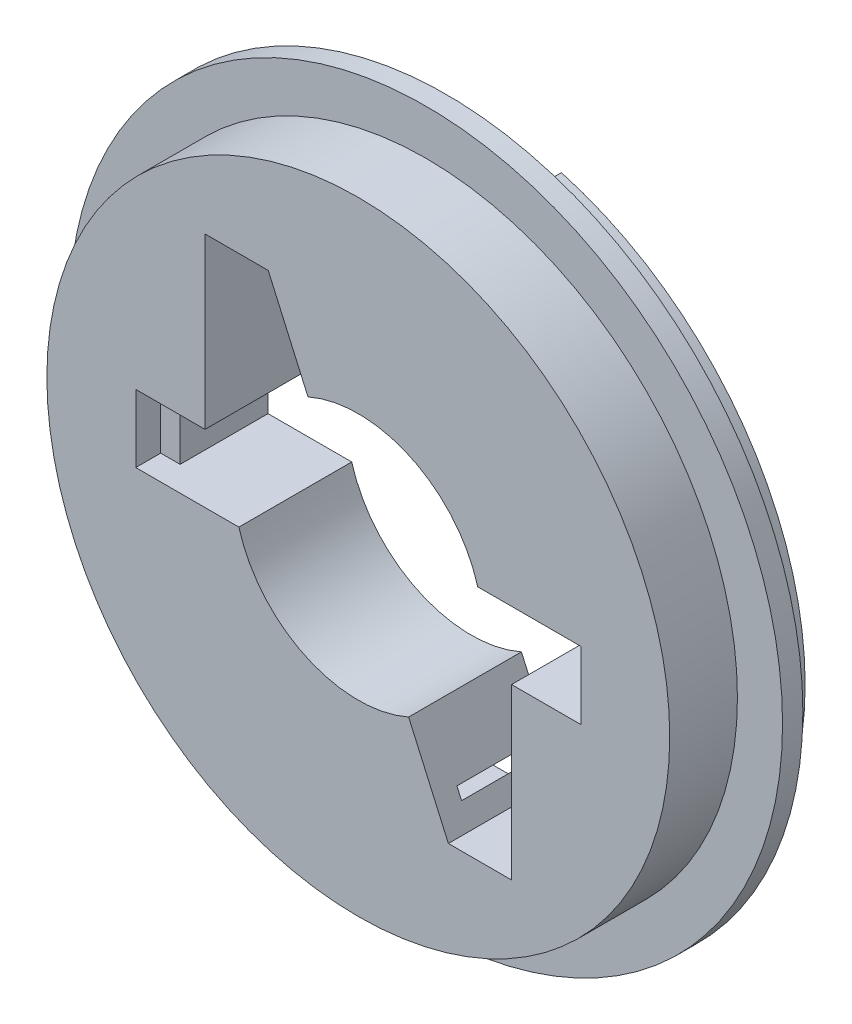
ISO-10303-21;
HEADER;
FILE_DESCRIPTION(('STEP AP214'),'2;1');
FILE_NAME('part.step','',(''),(''),'','','');
FILE_SCHEMA(('AUTOMOTIVE_DESIGN { 1 0 10303 214 1 1 1 1 }'));
ENDSEC;
DATA;
#1=APPLICATION_CONTEXT('core data for automotive mechanical design processes');
#2=APPLICATION_PROTOCOL_DEFINITION('international standard','automotive_design',2000,#1);
#3=PRODUCT_CONTEXT('',#1,'mechanical');
#4=PRODUCT('Part','Part','',(#3));
#5=PRODUCT_RELATED_PRODUCT_CATEGORY('part','',(#4));
#6=PRODUCT_DEFINITION_FORMATION('','',#4);
#7=PRODUCT_DEFINITION_CONTEXT('part definition',#1,'design');
#8=PRODUCT_DEFINITION('design','',#6,#7);
#9=PRODUCT_DEFINITION_SHAPE('','',#8);
#10=(LENGTH_UNIT() NAMED_UNIT(*) SI_UNIT(.MILLI.,.METRE.));
#11=(NAMED_UNIT(*) PLANE_ANGLE_UNIT() SI_UNIT($,.RADIAN.));
#12=(NAMED_UNIT(*) SI_UNIT($,.STERADIAN.) SOLID_ANGLE_UNIT());
#13=UNCERTAINTY_MEASURE_WITH_UNIT(LENGTH_MEASURE(1.E-05),#10,'distance_accuracy_value','');
#14=(GEOMETRIC_REPRESENTATION_CONTEXT(3) GLOBAL_UNCERTAINTY_ASSIGNED_CONTEXT((#13)) GLOBAL_UNIT_ASSIGNED_CONTEXT((#10,
#11,#12)) REPRESENTATION_CONTEXT('',''));
#15=CARTESIAN_POINT('',(0.,0.,0.));
#16=DIRECTION('',(0.,0.,1.));
#17=DIRECTION('',(1.,0.,0.));
#18=AXIS2_PLACEMENT_3D('',#15,#16,#17);
#19=CARTESIAN_POINT('',(2.,-4.5,-11.));
#20=DIRECTION('',(0.,0.,1.));
#21=DIRECTION('',(-1.,0.,0.));
#22=AXIS2_PLACEMENT_3D('',#19,#20,#21);
#23=PLANE('',#22);
#24=DIRECTION('',(-1.,0.,0.));
#25=VECTOR('',#24,1.);
#26=CARTESIAN_POINT('',(-1.75,-5.5,-11.));
#27=LINE('',#26,#25);
#28=CARTESIAN_POINT('',(-1.5,-5.5,-11.));
#29=VERTEX_POINT('',#28);
#30=CARTESIAN_POINT('',(-2.,-5.5,-11.));
#31=VERTEX_POINT('',#30);
#32=EDGE_CURVE('E498',#29,#31,#27,.T.);
#33=ORIENTED_EDGE('',*,*,#32,.F.);
#34=DIRECTION('',(0.,-1.,0.));
#35=VECTOR('',#34,1.);
#36=CARTESIAN_POINT('',(-1.5,-5.,-11.));
#37=LINE('',#36,#35);
#38=CARTESIAN_POINT('',(-1.49999999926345,-4.5,-11.));
#39=VERTEX_POINT('',#38);
#40=EDGE_CURVE('E497',#39,#29,#37,.T.);
#41=ORIENTED_EDGE('',*,*,#40,.F.);
#42=DIRECTION('',(-1.,0.,0.));
#43=VECTOR('',#42,1.);
#44=CARTESIAN_POINT('',(0.0391867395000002,-4.5,-11.));
#45=LINE('',#44,#43);
#46=CARTESIAN_POINT('',(1.5,-4.5,-11.));
#47=VERTEX_POINT('',#46);
#48=EDGE_CURVE('E638',#47,#39,#45,.T.);
#49=ORIENTED_EDGE('',*,*,#48,.F.);
#50=DIRECTION('',(0.,1.,0.));
#51=VECTOR('',#50,1.);
#52=CARTESIAN_POINT('',(1.5,-5.,-11.));
#53=LINE('',#52,#51);
#54=CARTESIAN_POINT('',(1.5,-5.5,-11.));
#55=VERTEX_POINT('',#54);
#56=EDGE_CURVE('E442',#55,#47,#53,.T.);
#57=ORIENTED_EDGE('',*,*,#56,.F.);
#58=DIRECTION('',(-1.,0.,0.));
#59=VECTOR('',#58,1.);
#60=CARTESIAN_POINT('',(1.75,-5.5,-11.));
#61=LINE('',#60,#59);
#62=CARTESIAN_POINT('',(2.,-5.5,-11.));
#63=VERTEX_POINT('',#62);
#64=EDGE_CURVE('E432',#63,#55,#61,.T.);
#65=ORIENTED_EDGE('',*,*,#64,.F.);
#66=DIRECTION('',(0.,1.,0.));
#67=VECTOR('',#66,1.);
#68=CARTESIAN_POINT('',(2.,-6.312302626,-11.));
#69=LINE('',#68,#67);
#70=CARTESIAN_POINT('',(1.99999999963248,-7.12460525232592,-11.00000000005));
#71=VERTEX_POINT('',#70);
#72=EDGE_CURVE('E421',#71,#63,#69,.T.);
#73=ORIENTED_EDGE('',*,*,#72,.F.);
#74=CARTESIAN_POINT('',(0.,0.,-11.00000000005));
#75=DIRECTION('',(0.,0.,1.));
#76=DIRECTION('',(1.,0.,0.));
#77=AXIS2_PLACEMENT_3D('',#74,#75,#76);
#78=CIRCLE('',#77,7.4);
#79=CARTESIAN_POINT('',(-1.99999999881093,-7.12460525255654,-11.00000000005));
#80=VERTEX_POINT('',#79);
#81=EDGE_CURVE('E482',#71,#80,#78,.F.);
#82=ORIENTED_EDGE('',*,*,#81,.T.);
#83=DIRECTION('',(0.,-1.,0.));
#84=VECTOR('',#83,1.);
#85=CARTESIAN_POINT('',(-2.,-6.312302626,-11.));
#86=LINE('',#85,#84);
#87=EDGE_CURVE('E516',#31,#80,#86,.T.);
#88=ORIENTED_EDGE('',*,*,#87,.F.);
#89=EDGE_LOOP('',(#33,#41,#49,#57,#65,#73,#82,#88));
#90=FACE_BOUND('',#89,.T.);
#91=ADVANCED_FACE('F17',(#90),#23,.F.);
#92=CARTESIAN_POINT('',(-2.,4.5,-11.));
#93=DIRECTION('',(0.,0.,1.));
#94=DIRECTION('',(1.,0.,0.));
#95=AXIS2_PLACEMENT_3D('',#92,#93,#94);
#96=PLANE('',#95);
#97=DIRECTION('',(1.,0.,0.));
#98=VECTOR('',#97,1.);
#99=CARTESIAN_POINT('',(1.75,5.5,-11.));
#100=LINE('',#99,#98);
#101=CARTESIAN_POINT('',(1.5,5.5,-11.));
#102=VERTEX_POINT('',#101);
#103=CARTESIAN_POINT('',(2.,5.5,-11.));
#104=VERTEX_POINT('',#103);
#105=EDGE_CURVE('E468',#102,#104,#100,.T.);
#106=ORIENTED_EDGE('',*,*,#105,.F.);
#107=DIRECTION('',(0.,1.,0.));
#108=VECTOR('',#107,1.);
#109=CARTESIAN_POINT('',(1.5,5.,-11.));
#110=LINE('',#109,#108);
#111=CARTESIAN_POINT('',(1.49999999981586,4.5,-11.));
#112=VERTEX_POINT('',#111);
#113=EDGE_CURVE('E651',#112,#102,#110,.T.);
#114=ORIENTED_EDGE('',*,*,#113,.F.);
#115=DIRECTION('',(1.,0.,0.));
#116=VECTOR('',#115,1.);
#117=CARTESIAN_POINT('',(-0.0391867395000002,4.5,-11.));
#118=LINE('',#117,#116);
#119=CARTESIAN_POINT('',(-1.5,4.5,-11.));
#120=VERTEX_POINT('',#119);
#121=EDGE_CURVE('E610',#120,#112,#118,.T.);
#122=ORIENTED_EDGE('',*,*,#121,.F.);
#123=DIRECTION('',(0.,-1.,0.));
#124=VECTOR('',#123,1.);
#125=CARTESIAN_POINT('',(-1.5,5.,-11.));
#126=LINE('',#125,#124);
#127=CARTESIAN_POINT('',(-1.5,5.5,-11.));
#128=VERTEX_POINT('',#127);
#129=EDGE_CURVE('E537',#128,#120,#126,.T.);
#130=ORIENTED_EDGE('',*,*,#129,.F.);
#131=DIRECTION('',(1.,0.,0.));
#132=VECTOR('',#131,1.);
#133=CARTESIAN_POINT('',(-1.75,5.5,-11.));
#134=LINE('',#133,#132);
#135=CARTESIAN_POINT('',(-2.,5.5,-11.));
#136=VERTEX_POINT('',#135);
#137=EDGE_CURVE('E528',#136,#128,#134,.T.);
#138=ORIENTED_EDGE('',*,*,#137,.F.);
#139=DIRECTION('',(0.,-1.,0.));
#140=VECTOR('',#139,1.);
#141=CARTESIAN_POINT('',(-2.,6.312302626,-11.));
#142=LINE('',#141,#140);
#143=CARTESIAN_POINT('',(-2.00000000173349,7.12460525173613,-11.00000000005));
#144=VERTEX_POINT('',#143);
#145=EDGE_CURVE('E517',#144,#136,#142,.T.);
#146=ORIENTED_EDGE('',*,*,#145,.F.);
#147=CARTESIAN_POINT('',(0.,0.,-11.00000000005));
#148=DIRECTION('',(0.,0.,1.));
#149=DIRECTION('',(1.,0.,0.));
#150=AXIS2_PLACEMENT_3D('',#147,#148,#149);
#151=CIRCLE('',#150,7.4);
#152=CARTESIAN_POINT('',(2.00000000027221,7.12460525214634,-11.00000000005));
#153=VERTEX_POINT('',#152);
#154=EDGE_CURVE('E479',#144,#153,#151,.F.);
#155=ORIENTED_EDGE('',*,*,#154,.T.);
#156=DIRECTION('',(0.,1.,0.));
#157=VECTOR('',#156,1.);
#158=CARTESIAN_POINT('',(2.,6.312302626,-11.));
#159=LINE('',#158,#157);
#160=EDGE_CURVE('E485',#104,#153,#159,.T.);
#161=ORIENTED_EDGE('',*,*,#160,.F.);
#162=EDGE_LOOP('',(#106,#114,#122,#130,#138,#146,#155,#161));
#163=FACE_BOUND('',#162,.T.);
#164=ADVANCED_FACE('F980',(#163),#96,.F.);
#165=CARTESIAN_POINT('',(-1.788360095,4.5,-9.5));
#166=DIRECTION('',(0.,-1.,0.));
#167=DIRECTION('',(0.,0.,-1.));
#168=AXIS2_PLACEMENT_3D('',#165,#166,#167);
#169=PLANE('',#168);
#170=DIRECTION('',(-1.,0.,0.));
#171=VECTOR('',#170,1.);
#172=CARTESIAN_POINT('',(-0.0391867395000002,4.5,-9.5));
#173=LINE('',#172,#171);
#174=CARTESIAN_POINT('',(1.709986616,4.5,-9.5));
#175=VERTEX_POINT('',#174);
#176=CARTESIAN_POINT('',(-1.788360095,4.5,-9.5));
#177=VERTEX_POINT('',#176);
#178=EDGE_CURVE('E293',#175,#177,#173,.T.);
#179=ORIENTED_EDGE('',*,*,#178,.T.);
#180=DIRECTION('',(0.,0.,1.));
#181=VECTOR('',#180,1.);
#182=CARTESIAN_POINT('',(-1.788360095,4.5,-10.5));
#183=LINE('',#182,#181);
#184=CARTESIAN_POINT('',(-1.78836009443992,4.5000000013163,-11.5));
#185=VERTEX_POINT('',#184);
#186=EDGE_CURVE('E350',#185,#177,#183,.T.);
#187=ORIENTED_EDGE('',*,*,#186,.F.);
#188=DIRECTION('',(1.,0.,0.));
#189=VECTOR('',#188,1.);
#190=CARTESIAN_POINT('',(-0.0391867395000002,4.5,-11.5));
#191=LINE('',#190,#189);
#192=CARTESIAN_POINT('',(-1.50000000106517,4.5000000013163,-11.5));
#193=VERTEX_POINT('',#192);
#194=EDGE_CURVE('E608',#185,#193,#191,.T.);
#195=ORIENTED_EDGE('',*,*,#194,.T.);
#196=DIRECTION('',(0.,0.,-1.));
#197=VECTOR('',#196,1.);
#198=CARTESIAN_POINT('',(-1.5,4.5,-11.25));
#199=LINE('',#198,#197);
#200=EDGE_CURVE('E534',#120,#193,#199,.T.);
#201=ORIENTED_EDGE('',*,*,#200,.F.);
#202=ORIENTED_EDGE('',*,*,#121,.T.);
#203=DIRECTION('',(0.,0.,1.));
#204=VECTOR('',#203,1.);
#205=CARTESIAN_POINT('',(1.5,4.5,-11.25));
#206=LINE('',#205,#204);
#207=CARTESIAN_POINT('',(1.50000000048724,4.5,-11.5));
#208=VERTEX_POINT('',#207);
#209=EDGE_CURVE('E467',#208,#112,#206,.T.);
#210=ORIENTED_EDGE('',*,*,#209,.F.);
#211=DIRECTION('',(1.,0.,0.));
#212=VECTOR('',#211,1.);
#213=CARTESIAN_POINT('',(-0.0391867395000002,4.5,-11.5));
#214=LINE('',#213,#212);
#215=CARTESIAN_POINT('',(1.709986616,4.5,-11.5));
#216=VERTEX_POINT('',#215);
#217=EDGE_CURVE('E294',#208,#216,#214,.T.);
#218=ORIENTED_EDGE('',*,*,#217,.T.);
#219=DIRECTION('',(0.,0.,-1.));
#220=VECTOR('',#219,1.);
#221=CARTESIAN_POINT('',(1.709986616,4.5,-10.5));
#222=LINE('',#221,#220);
#223=EDGE_CURVE('E600',#175,#216,#222,.T.);
#224=ORIENTED_EDGE('',*,*,#223,.F.);
#225=EDGE_LOOP('',(#179,#187,#195,#201,#202,#210,#218,#224));
#226=FACE_BOUND('',#225,.T.);
#227=ADVANCED_FACE('F984',(#226),#169,.T.);
#228=CARTESIAN_POINT('',(-1.788360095,3.8,-9.5));
#229=DIRECTION('',(0.,0.,1.));
#230=DIRECTION('',(1.,0.,0.));
#231=AXIS2_PLACEMENT_3D('',#228,#229,#230);
#232=PLANE('',#231);
#233=ORIENTED_EDGE('',*,*,#178,.F.);
#234=DIRECTION('',(0.,1.,0.));
#235=VECTOR('',#234,1.);
#236=CARTESIAN_POINT('',(1.709986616,4.15,-9.5));
#237=LINE('',#236,#235);
#238=CARTESIAN_POINT('',(1.709986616,3.8,-9.5));
#239=VERTEX_POINT('',#238);
#240=EDGE_CURVE('E299',#239,#175,#237,.T.);
#241=ORIENTED_EDGE('',*,*,#240,.F.);
#242=DIRECTION('',(1.,0.,0.));
#243=VECTOR('',#242,1.);
#244=CARTESIAN_POINT('',(0.0123427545,3.8,-9.5));
#245=LINE('',#244,#243);
#246=CARTESIAN_POINT('',(-1.68530110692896,3.79999999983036,-9.5));
#247=VERTEX_POINT('',#246);
#248=EDGE_CURVE('E296',#247,#239,#245,.T.);
#249=ORIENTED_EDGE('',*,*,#248,.F.);
#250=DIRECTION('',(-0.405417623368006,0.914131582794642,0.));
#251=VECTOR('',#250,1.);
#252=CARTESIAN_POINT('',(-1.114898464,2.513861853,-9.5));
#253=LINE('',#252,#251);
#254=CARTESIAN_POINT('',(-1.7883600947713,4.03237636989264,-9.5));
#255=VERTEX_POINT('',#254);
#256=EDGE_CURVE('E21',#255,#247,#253,.F.);
#257=ORIENTED_EDGE('',*,*,#256,.F.);
#258=DIRECTION('',(0.,-1.,0.));
#259=VECTOR('',#258,1.);
#260=CARTESIAN_POINT('',(-1.788360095,4.266188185,-9.5));
#261=LINE('',#260,#259);
#262=EDGE_CURVE('E304',#177,#255,#261,.T.);
#263=ORIENTED_EDGE('',*,*,#262,.F.);
#264=EDGE_LOOP('',(#233,#241,#249,#257,#263));
#265=FACE_BOUND('',#264,.T.);
#266=ADVANCED_FACE('F297',(#265),#232,.F.);
#267=CARTESIAN_POINT('',(1.709986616,4.5,-11.5));
#268=DIRECTION('',(-1.,0.,0.));
#269=DIRECTION('',(0.,-1.,0.));
#270=AXIS2_PLACEMENT_3D('',#267,#268,#269);
#271=PLANE('',#270);
#272=ORIENTED_EDGE('',*,*,#240,.T.);
#273=ORIENTED_EDGE('',*,*,#223,.T.);
#274=DIRECTION('',(0.,-1.,0.));
#275=VECTOR('',#274,1.);
#276=CARTESIAN_POINT('',(1.709986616,4.15,-11.5));
#277=LINE('',#276,#275);
#278=CARTESIAN_POINT('',(1.70998661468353,3.79999999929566,-11.5));
#279=VERTEX_POINT('',#278);
#280=EDGE_CURVE('E595',#216,#279,#277,.T.);
#281=ORIENTED_EDGE('',*,*,#280,.T.);
#282=DIRECTION('',(0.,0.,-1.));
#283=VECTOR('',#282,1.);
#284=CARTESIAN_POINT('',(1.709986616,3.8,-10.5));
#285=LINE('',#284,#283);
#286=EDGE_CURVE('E303',#239,#279,#285,.T.);
#287=ORIENTED_EDGE('',*,*,#286,.F.);
#288=EDGE_LOOP('',(#272,#273,#281,#287));
#289=FACE_BOUND('',#288,.T.);
#290=ADVANCED_FACE('F991',(#289),#271,.T.);
#291=CARTESIAN_POINT('',(-1.5,4.5,-11.));
#292=DIRECTION('',(1.,0.,0.));
#293=DIRECTION('',(0.,0.,-1.));
#294=AXIS2_PLACEMENT_3D('',#291,#292,#293);
#295=PLANE('',#294);
#296=ORIENTED_EDGE('',*,*,#129,.T.);
#297=ORIENTED_EDGE('',*,*,#200,.T.);
#298=DIRECTION('',(0.,1.,0.));
#299=VECTOR('',#298,1.);
#300=CARTESIAN_POINT('',(-1.5000000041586,0.,-11.5));
#301=LINE('',#300,#299);
#302=CARTESIAN_POINT('',(-1.5000000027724,5.50000000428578,-11.5));
#303=VERTEX_POINT('',#302);
#304=EDGE_CURVE('E342',#193,#303,#301,.T.);
#305=ORIENTED_EDGE('',*,*,#304,.T.);
#306=DIRECTION('',(0.,0.,-1.));
#307=VECTOR('',#306,1.);
#308=CARTESIAN_POINT('',(-1.5,5.5,-11.25));
#309=LINE('',#308,#307);
#310=EDGE_CURVE('E525',#128,#303,#309,.T.);
#311=ORIENTED_EDGE('',*,*,#310,.F.);
#312=EDGE_LOOP('',(#296,#297,#305,#311));
#313=FACE_BOUND('',#312,.T.);
#314=ADVANCED_FACE('F994',(#313),#295,.T.);
#315=CARTESIAN_POINT('',(-2.,5.5,-11.5));
#316=DIRECTION('',(0.,1.,0.));
#317=DIRECTION('',(0.,0.,1.));
#318=AXIS2_PLACEMENT_3D('',#315,#316,#317);
#319=PLANE('',#318);
#320=ORIENTED_EDGE('',*,*,#137,.T.);
#321=ORIENTED_EDGE('',*,*,#310,.T.);
#322=DIRECTION('',(-1.,0.,0.));
#323=VECTOR('',#322,1.);
#324=CARTESIAN_POINT('',(-2.8573494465,5.50000000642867,-11.5));
#325=LINE('',#324,#323);
#326=CARTESIAN_POINT('',(-1.99999999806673,5.50000000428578,-11.5));
#327=VERTEX_POINT('',#326);
#328=EDGE_CURVE('E520',#303,#327,#325,.T.);
#329=ORIENTED_EDGE('',*,*,#328,.T.);
#330=DIRECTION('',(0.,0.,-1.));
#331=VECTOR('',#330,1.);
#332=CARTESIAN_POINT('',(-2.,5.5,-11.25));
#333=LINE('',#332,#331);
#334=EDGE_CURVE('E513',#136,#327,#333,.T.);
#335=ORIENTED_EDGE('',*,*,#334,.F.);
#336=EDGE_LOOP('',(#320,#321,#329,#335));
#337=FACE_BOUND('',#336,.T.);
#338=ADVANCED_FACE('F998',(#337),#319,.T.);
#339=CARTESIAN_POINT('',(-2.,5.5,-11.));
#340=DIRECTION('',(1.,0.,0.));
#341=DIRECTION('',(0.,0.,-1.));
#342=AXIS2_PLACEMENT_3D('',#339,#340,#341);
#343=PLANE('',#342);
#344=ORIENTED_EDGE('',*,*,#334,.T.);
#345=DIRECTION('',(0.,1.,0.));
#346=VECTOR('',#345,1.);
#347=CARTESIAN_POINT('',(-1.9999999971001,0.,-11.5));
#348=LINE('',#347,#346);
#349=CARTESIAN_POINT('',(-2.00000000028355,7.12460525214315,-11.5));
#350=VERTEX_POINT('',#349);
#351=EDGE_CURVE('E522',#327,#350,#348,.T.);
#352=ORIENTED_EDGE('',*,*,#351,.T.);
#353=DIRECTION('',(0.,0.,-1.));
#354=VECTOR('',#353,1.);
#355=CARTESIAN_POINT('',(-2.00000000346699,7.12460525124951,-11.225));
#356=LINE('',#355,#354);
#357=EDGE_CURVE('E510',#350,#144,#356,.F.);
#358=ORIENTED_EDGE('',*,*,#357,.T.);
#359=ORIENTED_EDGE('',*,*,#145,.T.);
#360=EDGE_LOOP('',(#344,#352,#358,#359));
#361=FACE_BOUND('',#360,.T.);
#362=ADVANCED_FACE('F1002',(#361),#343,.T.);
#363=CARTESIAN_POINT('',(-2.,-7.124605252,-11.5));
#364=DIRECTION('',(1.,0.,0.));
#365=DIRECTION('',(0.,1.,0.));
#366=AXIS2_PLACEMENT_3D('',#363,#364,#365);
#367=PLANE('',#366);
#368=DIRECTION('',(0.,0.,-1.));
#369=VECTOR('',#368,1.);
#370=CARTESIAN_POINT('',(-2.,-5.5,-11.25));
#371=LINE('',#370,#369);
#372=CARTESIAN_POINT('',(-1.99999999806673,-5.50000000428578,-11.5));
#373=VERTEX_POINT('',#372);
#374=EDGE_CURVE('E494',#31,#373,#371,.T.);
#375=ORIENTED_EDGE('',*,*,#374,.F.);
#376=ORIENTED_EDGE('',*,*,#87,.T.);
#377=DIRECTION('',(0.,0.,1.));
#378=VECTOR('',#377,1.);
#379=CARTESIAN_POINT('',(-1.99999999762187,-7.12460525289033,-11.225));
#380=LINE('',#379,#378);
#381=CARTESIAN_POINT('',(-1.99999999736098,-7.12460525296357,-11.5));
#382=VERTEX_POINT('',#381);
#383=EDGE_CURVE('E508',#80,#382,#380,.F.);
#384=ORIENTED_EDGE('',*,*,#383,.T.);
#385=DIRECTION('',(0.,1.,0.));
#386=VECTOR('',#385,1.);
#387=CARTESIAN_POINT('',(-1.9999999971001,0.,-11.5));
#388=LINE('',#387,#386);
#389=EDGE_CURVE('E505',#382,#373,#388,.T.);
#390=ORIENTED_EDGE('',*,*,#389,.T.);
#391=EDGE_LOOP('',(#375,#376,#384,#390));
#392=FACE_BOUND('',#391,.T.);
#393=ADVANCED_FACE('F1006',(#392),#367,.T.);
#394=CARTESIAN_POINT('',(-2.,-5.5,-11.5));
#395=DIRECTION('',(0.,-1.,0.));
#396=DIRECTION('',(1.,0.,0.));
#397=AXIS2_PLACEMENT_3D('',#394,#395,#396);
#398=PLANE('',#397);
#399=ORIENTED_EDGE('',*,*,#32,.T.);
#400=ORIENTED_EDGE('',*,*,#374,.T.);
#401=DIRECTION('',(1.,0.,0.));
#402=VECTOR('',#401,1.);
#403=CARTESIAN_POINT('',(-2.8573494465,-5.50000000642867,-11.5));
#404=LINE('',#403,#402);
#405=CARTESIAN_POINT('',(-1.50000000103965,-5.50000000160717,-11.5));
#406=VERTEX_POINT('',#405);
#407=EDGE_CURVE('E501',#373,#406,#404,.T.);
#408=ORIENTED_EDGE('',*,*,#407,.T.);
#409=DIRECTION('',(0.,0.,-1.));
#410=VECTOR('',#409,1.);
#411=CARTESIAN_POINT('',(-1.5,-5.5,-11.25));
#412=LINE('',#411,#410);
#413=EDGE_CURVE('E686',#29,#406,#412,.T.);
#414=ORIENTED_EDGE('',*,*,#413,.F.);
#415=EDGE_LOOP('',(#399,#400,#408,#414));
#416=FACE_BOUND('',#415,.T.);
#417=ADVANCED_FACE('F1010',(#416),#398,.T.);
#418=CARTESIAN_POINT('',(-1.5,-5.5,-11.5));
#419=DIRECTION('',(1.,0.,0.));
#420=DIRECTION('',(0.,1.,0.));
#421=AXIS2_PLACEMENT_3D('',#418,#419,#420);
#422=PLANE('',#421);
#423=ORIENTED_EDGE('',*,*,#40,.T.);
#424=ORIENTED_EDGE('',*,*,#413,.T.);
#425=DIRECTION('',(0.,1.,0.));
#426=VECTOR('',#425,1.);
#427=CARTESIAN_POINT('',(-1.5000000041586,0.,-11.5));
#428=LINE('',#427,#426);
#429=CARTESIAN_POINT('',(-1.50000000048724,-4.50000000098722,-11.5));
#430=VERTEX_POINT('',#429);
#431=EDGE_CURVE('E504',#406,#430,#428,.T.);
#432=ORIENTED_EDGE('',*,*,#431,.T.);
#433=DIRECTION('',(0.,0.,-1.));
#434=VECTOR('',#433,1.);
#435=CARTESIAN_POINT('',(-1.49999999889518,-4.5,-10.5));
#436=LINE('',#435,#434);
#437=EDGE_CURVE('E641',#39,#430,#436,.T.);
#438=ORIENTED_EDGE('',*,*,#437,.F.);
#439=EDGE_LOOP('',(#423,#424,#432,#438));
#440=FACE_BOUND('',#439,.T.);
#441=ADVANCED_FACE('F1014',(#440),#422,.T.);
#442=CARTESIAN_POINT('',(1.788360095,-3.8,-9.5));
#443=DIRECTION('',(0.,0.,1.));
#444=DIRECTION('',(-1.,0.,0.));
#445=AXIS2_PLACEMENT_3D('',#442,#443,#444);
#446=PLANE('',#445);
#447=DIRECTION('',(1.,0.,0.));
#448=VECTOR('',#447,1.);
#449=CARTESIAN_POINT('',(0.0391867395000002,-4.5,-9.5));
#450=LINE('',#449,#448);
#451=CARTESIAN_POINT('',(-1.709986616,-4.5,-9.5));
#452=VERTEX_POINT('',#451);
#453=CARTESIAN_POINT('',(1.788360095,-4.5,-9.5));
#454=VERTEX_POINT('',#453);
#455=EDGE_CURVE('E486',#452,#454,#450,.T.);
#456=ORIENTED_EDGE('',*,*,#455,.F.);
#457=DIRECTION('',(0.,-1.,0.));
#458=VECTOR('',#457,1.);
#459=CARTESIAN_POINT('',(-1.709986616,-4.15,-9.5));
#460=LINE('',#459,#458);
#461=CARTESIAN_POINT('',(-1.709986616,-3.8,-9.5));
#462=VERTEX_POINT('',#461);
#463=EDGE_CURVE('E642',#462,#452,#460,.T.);
#464=ORIENTED_EDGE('',*,*,#463,.F.);
#465=DIRECTION('',(-1.,0.,0.));
#466=VECTOR('',#465,1.);
#467=CARTESIAN_POINT('',(-0.0123427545,-3.8,-9.5));
#468=LINE('',#467,#466);
#469=CARTESIAN_POINT('',(1.68530110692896,-3.79999999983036,-9.5));
#470=VERTEX_POINT('',#469);
#471=EDGE_CURVE('E691',#470,#462,#468,.T.);
#472=ORIENTED_EDGE('',*,*,#471,.F.);
#473=DIRECTION('',(0.405417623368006,-0.914131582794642,0.));
#474=VECTOR('',#473,1.);
#475=CARTESIAN_POINT('',(1.114898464,-2.513861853,-9.5));
#476=LINE('',#475,#474);
#477=CARTESIAN_POINT('',(1.7883600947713,-4.03237636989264,-9.5));
#478=VERTEX_POINT('',#477);
#479=EDGE_CURVE('E660',#478,#470,#476,.F.);
#480=ORIENTED_EDGE('',*,*,#479,.F.);
#481=DIRECTION('',(0.,1.,0.));
#482=VECTOR('',#481,1.);
#483=CARTESIAN_POINT('',(1.788360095,-4.15,-9.5));
#484=LINE('',#483,#482);
#485=EDGE_CURVE('E658',#454,#478,#484,.T.);
#486=ORIENTED_EDGE('',*,*,#485,.F.);
#487=EDGE_LOOP('',(#456,#464,#472,#480,#486));
#488=FACE_BOUND('',#487,.T.);
#489=ADVANCED_FACE('F777',(#488),#446,.F.);
#490=CARTESIAN_POINT('',(-1.709986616,-4.5,-11.5));
#491=DIRECTION('',(1.,0.,0.));
#492=DIRECTION('',(0.,1.,0.));
#493=AXIS2_PLACEMENT_3D('',#490,#491,#492);
#494=PLANE('',#493);
#495=ORIENTED_EDGE('',*,*,#463,.T.);
#496=DIRECTION('',(0.,0.,1.));
#497=VECTOR('',#496,1.);
#498=CARTESIAN_POINT('',(-1.709986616,-4.5,-10.5));
#499=LINE('',#498,#497);
#500=CARTESIAN_POINT('',(-1.709986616,-4.5,-11.5));
#501=VERTEX_POINT('',#500);
#502=EDGE_CURVE('E491',#501,#452,#499,.T.);
#503=ORIENTED_EDGE('',*,*,#502,.F.);
#504=DIRECTION('',(0.,1.,0.));
#505=VECTOR('',#504,1.);
#506=CARTESIAN_POINT('',(-1.7099866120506,0.,-11.5));
#507=LINE('',#506,#505);
#508=CARTESIAN_POINT('',(-1.70998661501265,-3.79999999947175,-11.5));
#509=VERTEX_POINT('',#508);
#510=EDGE_CURVE('E672',#501,#509,#507,.T.);
#511=ORIENTED_EDGE('',*,*,#510,.T.);
#512=DIRECTION('',(0.,0.,-1.));
#513=VECTOR('',#512,1.);
#514=CARTESIAN_POINT('',(-1.709986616,-3.8,-10.5));
#515=LINE('',#514,#513);
#516=EDGE_CURVE('E564',#462,#509,#515,.T.);
#517=ORIENTED_EDGE('',*,*,#516,.F.);
#518=EDGE_LOOP('',(#495,#503,#511,#517));
#519=FACE_BOUND('',#518,.T.);
#520=ADVANCED_FACE('F1021',(#519),#494,.T.);
#521=CARTESIAN_POINT('',(1.788360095,-4.5,-11.5));
#522=DIRECTION('',(0.,1.,0.));
#523=DIRECTION('',(-1.,0.,0.));
#524=AXIS2_PLACEMENT_3D('',#521,#522,#523);
#525=PLANE('',#524);
#526=DIRECTION('',(-1.,0.,0.));
#527=VECTOR('',#526,1.);
#528=CARTESIAN_POINT('',(0.0391867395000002,-4.5,-11.5));
#529=LINE('',#528,#527);
#530=CARTESIAN_POINT('',(1.78836009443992,-4.5000000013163,-11.5));
#531=VERTEX_POINT('',#530);
#532=CARTESIAN_POINT('',(1.50000000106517,-4.5000000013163,-11.5));
#533=VERTEX_POINT('',#532);
#534=EDGE_CURVE('E483',#531,#533,#529,.T.);
#535=ORIENTED_EDGE('',*,*,#534,.T.);
#536=DIRECTION('',(0.,0.,-1.));
#537=VECTOR('',#536,1.);
#538=CARTESIAN_POINT('',(1.5,-4.5,-11.25));
#539=LINE('',#538,#537);
#540=EDGE_CURVE('E439',#47,#533,#539,.T.);
#541=ORIENTED_EDGE('',*,*,#540,.F.);
#542=ORIENTED_EDGE('',*,*,#48,.T.);
#543=ORIENTED_EDGE('',*,*,#437,.T.);
#544=DIRECTION('',(-1.,0.,0.));
#545=VECTOR('',#544,1.);
#546=CARTESIAN_POINT('',(-2.8573494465,-4.50000000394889,-11.5));
#547=LINE('',#546,#545);
#548=EDGE_CURVE('E571',#430,#501,#547,.T.);
#549=ORIENTED_EDGE('',*,*,#548,.T.);
#550=ORIENTED_EDGE('',*,*,#502,.T.);
#551=ORIENTED_EDGE('',*,*,#455,.T.);
#552=DIRECTION('',(0.,0.,1.));
#553=VECTOR('',#552,1.);
#554=CARTESIAN_POINT('',(1.788360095,-4.5,-10.5));
#555=LINE('',#554,#553);
#556=EDGE_CURVE('E445',#531,#454,#555,.T.);
#557=ORIENTED_EDGE('',*,*,#556,.F.);
#558=EDGE_LOOP('',(#535,#541,#542,#543,#549,#550,#551,#557));
#559=FACE_BOUND('',#558,.T.);
#560=ADVANCED_FACE('F1024',(#559),#525,.T.);
#561=CARTESIAN_POINT('',(2.,5.5,-11.5));
#562=DIRECTION('',(-1.,0.,0.));
#563=DIRECTION('',(0.,0.,1.));
#564=AXIS2_PLACEMENT_3D('',#561,#562,#563);
#565=PLANE('',#564);
#566=DIRECTION('',(0.,0.,-1.));
#567=VECTOR('',#566,1.);
#568=CARTESIAN_POINT('',(2.,5.5,-11.25));
#569=LINE('',#568,#567);
#570=CARTESIAN_POINT('',(1.99999999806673,5.50000000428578,-11.5));
#571=VERTEX_POINT('',#570);
#572=EDGE_CURVE('E464',#104,#571,#569,.T.);
#573=ORIENTED_EDGE('',*,*,#572,.F.);
#574=ORIENTED_EDGE('',*,*,#160,.T.);
#575=DIRECTION('',(0.,0.,1.));
#576=VECTOR('',#575,1.);
#577=CARTESIAN_POINT('',(2.00000000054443,7.12460525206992,-11.225));
#578=LINE('',#577,#576);
#579=CARTESIAN_POINT('',(1.99999999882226,7.12460525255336,-11.5));
#580=VERTEX_POINT('',#579);
#581=EDGE_CURVE('E378',#153,#580,#578,.F.);
#582=ORIENTED_EDGE('',*,*,#581,.T.);
#583=DIRECTION('',(0.,-1.,0.));
#584=VECTOR('',#583,1.);
#585=CARTESIAN_POINT('',(1.9999999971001,0.,-11.5));
#586=LINE('',#585,#584);
#587=EDGE_CURVE('E475',#580,#571,#586,.T.);
#588=ORIENTED_EDGE('',*,*,#587,.T.);
#589=EDGE_LOOP('',(#573,#574,#582,#588));
#590=FACE_BOUND('',#589,.T.);
#591=ADVANCED_FACE('F1027',(#590),#565,.T.);
#592=CARTESIAN_POINT('',(1.5,5.5,-11.5));
#593=DIRECTION('',(0.,1.,0.));
#594=DIRECTION('',(0.,0.,1.));
#595=AXIS2_PLACEMENT_3D('',#592,#593,#594);
#596=PLANE('',#595);
#597=ORIENTED_EDGE('',*,*,#105,.T.);
#598=ORIENTED_EDGE('',*,*,#572,.T.);
#599=DIRECTION('',(-1.,0.,0.));
#600=VECTOR('',#599,1.);
#601=CARTESIAN_POINT('',(2.8573494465,5.50000000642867,-11.5));
#602=LINE('',#601,#600);
#603=CARTESIAN_POINT('',(1.50000000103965,5.50000000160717,-11.5));
#604=VERTEX_POINT('',#603);
#605=EDGE_CURVE('E471',#571,#604,#602,.T.);
#606=ORIENTED_EDGE('',*,*,#605,.T.);
#607=DIRECTION('',(0.,0.,-1.));
#608=VECTOR('',#607,1.);
#609=CARTESIAN_POINT('',(1.5,5.5,-11.25));
#610=LINE('',#609,#608);
#611=EDGE_CURVE('E635',#102,#604,#610,.T.);
#612=ORIENTED_EDGE('',*,*,#611,.F.);
#613=EDGE_LOOP('',(#597,#598,#606,#612));
#614=FACE_BOUND('',#613,.T.);
#615=ADVANCED_FACE('F1031',(#614),#596,.T.);
#616=CARTESIAN_POINT('',(1.5,4.5,-11.5));
#617=DIRECTION('',(-1.,0.,0.));
#618=DIRECTION('',(0.,0.,1.));
#619=AXIS2_PLACEMENT_3D('',#616,#617,#618);
#620=PLANE('',#619);
#621=ORIENTED_EDGE('',*,*,#113,.T.);
#622=ORIENTED_EDGE('',*,*,#611,.T.);
#623=DIRECTION('',(0.,-1.,0.));
#624=VECTOR('',#623,1.);
#625=CARTESIAN_POINT('',(1.50000000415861,0.,-11.5));
#626=LINE('',#625,#624);
#627=EDGE_CURVE('E474',#604,#208,#626,.T.);
#628=ORIENTED_EDGE('',*,*,#627,.T.);
#629=ORIENTED_EDGE('',*,*,#209,.T.);
#630=EDGE_LOOP('',(#621,#622,#628,#629));
#631=FACE_BOUND('',#630,.T.);
#632=ADVANCED_FACE('F1035',(#631),#620,.T.);
#633=CARTESIAN_POINT('',(1.5,-4.5,-11.5));
#634=DIRECTION('',(-1.,0.,0.));
#635=DIRECTION('',(0.,-1.,0.));
#636=AXIS2_PLACEMENT_3D('',#633,#634,#635);
#637=PLANE('',#636);
#638=ORIENTED_EDGE('',*,*,#56,.T.);
#639=ORIENTED_EDGE('',*,*,#540,.T.);
#640=DIRECTION('',(0.,-1.,0.));
#641=VECTOR('',#640,1.);
#642=CARTESIAN_POINT('',(1.50000000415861,0.,-11.5));
#643=LINE('',#642,#641);
#644=CARTESIAN_POINT('',(1.5000000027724,-5.50000000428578,-11.5));
#645=VERTEX_POINT('',#644);
#646=EDGE_CURVE('E426',#533,#645,#643,.T.);
#647=ORIENTED_EDGE('',*,*,#646,.T.);
#648=DIRECTION('',(0.,0.,-1.));
#649=VECTOR('',#648,1.);
#650=CARTESIAN_POINT('',(1.5,-5.5,-11.25));
#651=LINE('',#650,#649);
#652=EDGE_CURVE('E429',#55,#645,#651,.T.);
#653=ORIENTED_EDGE('',*,*,#652,.F.);
#654=EDGE_LOOP('',(#638,#639,#647,#653));
#655=FACE_BOUND('',#654,.T.);
#656=ADVANCED_FACE('F1039',(#655),#637,.T.);
#657=CARTESIAN_POINT('',(1.5,-5.5,-11.5));
#658=DIRECTION('',(0.,-1.,0.));
#659=DIRECTION('',(1.,0.,0.));
#660=AXIS2_PLACEMENT_3D('',#657,#658,#659);
#661=PLANE('',#660);
#662=ORIENTED_EDGE('',*,*,#64,.T.);
#663=ORIENTED_EDGE('',*,*,#652,.T.);
#664=DIRECTION('',(1.,0.,0.));
#665=VECTOR('',#664,1.);
#666=CARTESIAN_POINT('',(2.8573494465,-5.50000000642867,-11.5));
#667=LINE('',#666,#665);
#668=CARTESIAN_POINT('',(1.99999999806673,-5.50000000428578,-11.5));
#669=VERTEX_POINT('',#668);
#670=EDGE_CURVE('E424',#645,#669,#667,.T.);
#671=ORIENTED_EDGE('',*,*,#670,.T.);
#672=DIRECTION('',(0.,0.,-1.));
#673=VECTOR('',#672,1.);
#674=CARTESIAN_POINT('',(2.,-5.5,-11.25));
#675=LINE('',#674,#673);
#676=EDGE_CURVE('E417',#63,#669,#675,.T.);
#677=ORIENTED_EDGE('',*,*,#676,.F.);
#678=EDGE_LOOP('',(#662,#663,#671,#677));
#679=FACE_BOUND('',#678,.T.);
#680=ADVANCED_FACE('F1043',(#679),#661,.T.);
#681=CARTESIAN_POINT('',(2.,-5.5,-11.5));
#682=DIRECTION('',(-1.,0.,0.));
#683=DIRECTION('',(0.,-1.,0.));
#684=AXIS2_PLACEMENT_3D('',#681,#682,#683);
#685=PLANE('',#684);
#686=ORIENTED_EDGE('',*,*,#676,.T.);
#687=DIRECTION('',(0.,-1.,0.));
#688=VECTOR('',#687,1.);
#689=CARTESIAN_POINT('',(1.9999999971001,0.,-11.5));
#690=LINE('',#689,#688);
#691=CARTESIAN_POINT('',(1.99999999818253,-7.12460525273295,-11.5));
#692=VERTEX_POINT('',#691);
#693=EDGE_CURVE('E405',#669,#692,#690,.T.);
#694=ORIENTED_EDGE('',*,*,#693,.T.);
#695=DIRECTION('',(0.,0.,-1.));
#696=VECTOR('',#695,1.);
#697=CARTESIAN_POINT('',(1.99999999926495,-7.12460525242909,-11.225));
#698=LINE('',#697,#696);
#699=EDGE_CURVE('E420',#692,#71,#698,.F.);
#700=ORIENTED_EDGE('',*,*,#699,.T.);
#701=ORIENTED_EDGE('',*,*,#72,.T.);
#702=EDGE_LOOP('',(#686,#694,#700,#701));
#703=FACE_BOUND('',#702,.T.);
#704=ADVANCED_FACE('F1047',(#703),#685,.T.);
#705=CARTESIAN_POINT('',(0.,0.,-11.5));
#706=DIRECTION('',(0.,0.,1.));
#707=DIRECTION('',(1.,0.,0.));
#708=AXIS2_PLACEMENT_3D('',#705,#706,#707);
#709=CYLINDRICAL_SURFACE('',#708,7.4);
#710=CARTESIAN_POINT('',(0.,0.,-10.95));
#711=DIRECTION('',(0.,0.,1.));
#712=DIRECTION('',(1.,0.,0.));
#713=AXIS2_PLACEMENT_3D('',#710,#711,#712);
#714=CIRCLE('',#713,7.4);
#715=CARTESIAN_POINT('',(7.4,0.,-10.95));
#716=VERTEX_POINT('',#715);
#717=EDGE_CURVE('E414',#716,#716,#714,.F.);
#718=ORIENTED_EDGE('',*,*,#717,.T.);
#719=EDGE_LOOP('',(#718));
#720=FACE_BOUND('',#719,.T.);
#721=ORIENTED_EDGE('',*,*,#357,.F.);
#722=CARTESIAN_POINT('',(0.,0.,-11.5));
#723=DIRECTION('',(0.,0.,1.));
#724=DIRECTION('',(1.,0.,0.));
#725=AXIS2_PLACEMENT_3D('',#722,#723,#724);
#726=CIRCLE('',#725,7.4);
#727=EDGE_CURVE('E762',#350,#382,#726,.T.);
#728=ORIENTED_EDGE('',*,*,#727,.T.);
#729=ORIENTED_EDGE('',*,*,#383,.F.);
#730=ORIENTED_EDGE('',*,*,#81,.F.);
#731=ORIENTED_EDGE('',*,*,#699,.F.);
#732=CARTESIAN_POINT('',(0.,0.,-11.5));
#733=DIRECTION('',(0.,0.,1.));
#734=DIRECTION('',(1.,0.,0.));
#735=AXIS2_PLACEMENT_3D('',#732,#733,#734);
#736=CIRCLE('',#735,7.4);
#737=EDGE_CURVE('E759',#692,#580,#736,.T.);
#738=ORIENTED_EDGE('',*,*,#737,.T.);
#739=ORIENTED_EDGE('',*,*,#581,.F.);
#740=ORIENTED_EDGE('',*,*,#154,.F.);
#741=EDGE_LOOP('',(#721,#728,#729,#730,#731,#738,#739,#740));
#742=FACE_BOUND('',#741,.T.);
#743=ADVANCED_FACE('F1051',(#720,#742),#709,.T.);
#744=CARTESIAN_POINT('',(4.5,-0.75,-9.553084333));
#745=DIRECTION('',(0.,0.,1.));
#746=DIRECTION('',(1.,0.,0.));
#747=AXIS2_PLACEMENT_3D('',#744,#745,#746);
#748=PLANE('',#747);
#749=DIRECTION('',(0.,1.,0.));
#750=VECTOR('',#749,1.);
#751=CARTESIAN_POINT('',(4.5,0.,-9.553084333));
#752=LINE('',#751,#750);
#753=CARTESIAN_POINT('',(4.49999999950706,-0.75,-9.55308433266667));
#754=VERTEX_POINT('',#753);
#755=CARTESIAN_POINT('',(4.50000000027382,0.75,-9.55308433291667));
#756=VERTEX_POINT('',#755);
#757=EDGE_CURVE('E377',#754,#756,#752,.T.);
#758=ORIENTED_EDGE('',*,*,#757,.F.);
#759=DIRECTION('',(1.,0.,0.));
#760=VECTOR('',#759,1.);
#761=CARTESIAN_POINT('',(4.1631393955,-0.75,-9.5530843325));
#762=LINE('',#761,#760);
#763=CARTESIAN_POINT('',(4.93052748,-0.75,-9.55308433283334));
#764=VERTEX_POINT('',#763);
#765=EDGE_CURVE('E383',#754,#764,#762,.T.);
#766=ORIENTED_EDGE('',*,*,#765,.T.);
#767=DIRECTION('',(0.,1.,0.));
#768=VECTOR('',#767,1.);
#769=CARTESIAN_POINT('',(4.93052748,0.,-9.553084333));
#770=LINE('',#769,#768);
#771=CARTESIAN_POINT('',(4.93052748,0.75,-9.55308433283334));
#772=VERTEX_POINT('',#771);
#773=EDGE_CURVE('E356',#764,#772,#770,.T.);
#774=ORIENTED_EDGE('',*,*,#773,.T.);
#775=DIRECTION('',(-1.,0.,0.));
#776=VECTOR('',#775,1.);
#777=CARTESIAN_POINT('',(4.71526374,0.75,-9.553084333));
#778=LINE('',#777,#776);
#779=EDGE_CURVE('E375',#772,#756,#778,.T.);
#780=ORIENTED_EDGE('',*,*,#779,.T.);
#781=EDGE_LOOP('',(#758,#766,#774,#780));
#782=FACE_BOUND('',#781,.T.);
#783=ADVANCED_FACE('F1053',(#782),#748,.T.);
#784=CARTESIAN_POINT('',(4.5,-0.75,-11.5));
#785=DIRECTION('',(-1.,0.,0.));
#786=DIRECTION('',(0.,0.,1.));
#787=AXIS2_PLACEMENT_3D('',#784,#785,#786);
#788=PLANE('',#787);
#789=DIRECTION('',(0.,0.,-1.));
#790=VECTOR('',#789,1.);
#791=CARTESIAN_POINT('',(4.50000000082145,0.75,-10.25));
#792=LINE('',#791,#790);
#793=CARTESIAN_POINT('',(4.50000000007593,0.75,-11.5));
#794=VERTEX_POINT('',#793);
#795=EDGE_CURVE('E369',#756,#794,#792,.T.);
#796=ORIENTED_EDGE('',*,*,#795,.T.);
#797=DIRECTION('',(0.,-1.,0.));
#798=VECTOR('',#797,1.);
#799=CARTESIAN_POINT('',(4.49999999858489,0.,-11.5));
#800=LINE('',#799,#798);
#801=CARTESIAN_POINT('',(4.49999999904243,-0.750000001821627,-11.5));
#802=VERTEX_POINT('',#801);
#803=EDGE_CURVE('E364',#794,#802,#800,.T.);
#804=ORIENTED_EDGE('',*,*,#803,.T.);
#805=DIRECTION('',(0.,0.,1.));
#806=VECTOR('',#805,1.);
#807=CARTESIAN_POINT('',(4.49999999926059,-0.75,-10.25));
#808=LINE('',#807,#806);
#809=EDGE_CURVE('E387',#802,#754,#808,.T.);
#810=ORIENTED_EDGE('',*,*,#809,.T.);
#811=ORIENTED_EDGE('',*,*,#757,.T.);
#812=EDGE_LOOP('',(#796,#804,#810,#811));
#813=FACE_BOUND('',#812,.T.);
#814=ADVANCED_FACE('F1056',(#813),#788,.T.);
#815=CARTESIAN_POINT('',(-1.788360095,4.03237637,-9.5));
#816=DIRECTION('',(1.,0.,0.));
#817=DIRECTION('',(0.,0.,-1.));
#818=AXIS2_PLACEMENT_3D('',#815,#816,#817);
#819=PLANE('',#818);
#820=ORIENTED_EDGE('',*,*,#186,.T.);
#821=ORIENTED_EDGE('',*,*,#262,.T.);
#822=DIRECTION('',(0.,0.,-1.));
#823=VECTOR('',#822,1.);
#824=CARTESIAN_POINT('',(-1.78836009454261,4.03237636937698,-10.25));
#825=LINE('',#824,#823);
#826=CARTESIAN_POINT('',(-1.78836009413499,4.03237636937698,-11.5));
#827=VERTEX_POINT('',#826);
#828=EDGE_CURVE('E292',#255,#827,#825,.T.);
#829=ORIENTED_EDGE('',*,*,#828,.T.);
#830=DIRECTION('',(0.,1.,0.));
#831=VECTOR('',#830,1.);
#832=CARTESIAN_POINT('',(-1.78836009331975,0.,-11.5));
#833=LINE('',#832,#831);
#834=EDGE_CURVE('E336',#827,#185,#833,.T.);
#835=ORIENTED_EDGE('',*,*,#834,.T.);
#836=EDGE_LOOP('',(#820,#821,#829,#835));
#837=FACE_BOUND('',#836,.T.);
#838=ADVANCED_FACE('F1060',(#837),#819,.T.);
#839=CARTESIAN_POINT('',(-1.685301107,3.8,-11.5));
#840=DIRECTION('',(0.,1.,0.));
#841=DIRECTION('',(0.,0.,1.));
#842=AXIS2_PLACEMENT_3D('',#839,#840,#841);
#843=PLANE('',#842);
#844=ORIENTED_EDGE('',*,*,#286,.T.);
#845=DIRECTION('',(-1.,0.,0.));
#846=VECTOR('',#845,1.);
#847=CARTESIAN_POINT('',(2.8573494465,3.79999999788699,-11.5));
#848=LINE('',#847,#846);
#849=CARTESIAN_POINT('',(-1.68530110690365,3.79999999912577,-11.5));
#850=VERTEX_POINT('',#849);
#851=EDGE_CURVE('E308',#279,#850,#848,.T.);
#852=ORIENTED_EDGE('',*,*,#851,.T.);
#853=DIRECTION('',(0.,0.,1.));
#854=VECTOR('',#853,1.);
#855=CARTESIAN_POINT('',(-1.68530110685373,3.79999999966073,-10.25));
#856=LINE('',#855,#854);
#857=EDGE_CURVE('E290',#850,#247,#856,.T.);
#858=ORIENTED_EDGE('',*,*,#857,.T.);
#859=ORIENTED_EDGE('',*,*,#248,.T.);
#860=EDGE_LOOP('',(#844,#852,#858,#859));
#861=FACE_BOUND('',#860,.T.);
#862=ADVANCED_FACE('F306',(#861),#843,.T.);
#863=CARTESIAN_POINT('',(-3.395751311,4.5,-11.5));
#864=DIRECTION('',(0.,1.,0.));
#865=DIRECTION('',(0.,0.,1.));
#866=AXIS2_PLACEMENT_3D('',#863,#864,#865);
#867=PLANE('',#866);
#868=DIRECTION('',(0.,0.,-1.));
#869=VECTOR('',#868,1.);
#870=CARTESIAN_POINT('',(-3.395751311,4.5,-10.25));
#871=LINE('',#870,#869);
#872=CARTESIAN_POINT('',(-3.39575131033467,4.5000000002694,-9.));
#873=VERTEX_POINT('',#872);
#874=CARTESIAN_POINT('',(-3.39575131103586,4.50000000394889,-11.5));
#875=VERTEX_POINT('',#874);
#876=EDGE_CURVE('E310',#873,#875,#871,.T.);
#877=ORIENTED_EDGE('',*,*,#876,.T.);
#878=DIRECTION('',(1.,0.,0.));
#879=VECTOR('',#878,1.);
#880=CARTESIAN_POINT('',(-2.8573494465,4.50000000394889,-11.5));
#881=LINE('',#880,#879);
#882=CARTESIAN_POINT('',(-1.99575131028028,4.5000000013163,-11.5));
#883=VERTEX_POINT('',#882);
#884=EDGE_CURVE('E334',#875,#883,#881,.T.);
#885=ORIENTED_EDGE('',*,*,#884,.T.);
#886=DIRECTION('',(0.,0.,1.));
#887=VECTOR('',#886,1.);
#888=CARTESIAN_POINT('',(-1.995751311,4.5,-10.25));
#889=LINE('',#888,#887);
#890=CARTESIAN_POINT('',(-1.995751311,4.5,-9.));
#891=VERTEX_POINT('',#890);
#892=EDGE_CURVE('E331',#883,#891,#889,.T.);
#893=ORIENTED_EDGE('',*,*,#892,.T.);
#894=DIRECTION('',(1.,0.,0.));
#895=VECTOR('',#894,1.);
#896=CARTESIAN_POINT('',(-2.695751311,4.5,-9.));
#897=LINE('',#896,#895);
#898=EDGE_CURVE('E323',#873,#891,#897,.T.);
#899=ORIENTED_EDGE('',*,*,#898,.F.);
#900=EDGE_LOOP('',(#877,#885,#893,#899));
#901=FACE_BOUND('',#900,.T.);
#902=ADVANCED_FACE('F914',(#901),#867,.F.);
#903=CARTESIAN_POINT('',(-4.93052748,0.75,-9.));
#904=DIRECTION('',(0.,-1.,0.));
#905=DIRECTION('',(0.,0.,-1.));
#906=AXIS2_PLACEMENT_3D('',#903,#904,#905);
#907=PLANE('',#906);
#908=DIRECTION('',(0.,0.,-1.));
#909=VECTOR('',#908,1.);
#910=CARTESIAN_POINT('',(-4.5,0.75,-10.5265421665));
#911=LINE('',#910,#909);
#912=CARTESIAN_POINT('',(-4.5,0.75,-9.553084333));
#913=VERTEX_POINT('',#912);
#914=CARTESIAN_POINT('',(-4.49999999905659,0.750000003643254,-11.5));
#915=VERTEX_POINT('',#914);
#916=EDGE_CURVE('E551',#913,#915,#911,.T.);
#917=ORIENTED_EDGE('',*,*,#916,.T.);
#918=DIRECTION('',(1.,0.,0.));
#919=VECTOR('',#918,1.);
#920=CARTESIAN_POINT('',(-2.8573494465,0.750000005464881,-11.5));
#921=LINE('',#920,#919);
#922=CARTESIAN_POINT('',(-3.39575131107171,0.750000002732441,-11.5));
#923=VERTEX_POINT('',#922);
#924=EDGE_CURVE('E337',#915,#923,#921,.T.);
#925=ORIENTED_EDGE('',*,*,#924,.T.);
#926=DIRECTION('',(0.,0.,1.));
#927=VECTOR('',#926,1.);
#928=CARTESIAN_POINT('',(-3.395751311,0.75,-10.25));
#929=LINE('',#928,#927);
#930=CARTESIAN_POINT('',(-3.3957513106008,0.75,-9.));
#931=VERTEX_POINT('',#930);
#932=EDGE_CURVE('E548',#923,#931,#929,.T.);
#933=ORIENTED_EDGE('',*,*,#932,.T.);
#934=DIRECTION('',(-1.,0.,0.));
#935=VECTOR('',#934,1.);
#936=CARTESIAN_POINT('',(-4.1631393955,0.75,-9.));
#937=LINE('',#936,#935);
#938=CARTESIAN_POINT('',(-4.9305274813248,0.749999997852,-9.));
#939=VERTEX_POINT('',#938);
#940=EDGE_CURVE('E325',#931,#939,#937,.T.);
#941=ORIENTED_EDGE('',*,*,#940,.T.);
#942=DIRECTION('',(0.,0.,-1.));
#943=VECTOR('',#942,1.);
#944=CARTESIAN_POINT('',(-4.93052748,0.75,-10.25));
#945=LINE('',#944,#943);
#946=CARTESIAN_POINT('',(-4.93052748,0.75,-9.55308433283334));
#947=VERTEX_POINT('',#946);
#948=EDGE_CURVE('E574',#939,#947,#945,.T.);
#949=ORIENTED_EDGE('',*,*,#948,.T.);
#950=DIRECTION('',(-1.,0.,0.));
#951=VECTOR('',#950,1.);
#952=CARTESIAN_POINT('',(-4.71526374,0.75,-9.553084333));
#953=LINE('',#952,#951);
#954=EDGE_CURVE('E576',#913,#947,#953,.T.);
#955=ORIENTED_EDGE('',*,*,#954,.F.);
#956=EDGE_LOOP('',(#917,#925,#933,#941,#949,#955));
#957=FACE_BOUND('',#956,.T.);
#958=ADVANCED_FACE('F904',(#957),#907,.T.);
#959=CARTESIAN_POINT('',(-4.93052748,-0.75,-9.553084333));
#960=DIRECTION('',(0.,0.,1.));
#961=DIRECTION('',(1.,0.,0.));
#962=AXIS2_PLACEMENT_3D('',#959,#960,#961);
#963=PLANE('',#962);
#964=DIRECTION('',(1.,0.,0.));
#965=VECTOR('',#964,1.);
#966=CARTESIAN_POINT('',(-4.71526374,-0.75,-9.553084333));
#967=LINE('',#966,#965);
#968=CARTESIAN_POINT('',(-4.93052748,-0.75,-9.55308433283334));
#969=VERTEX_POINT('',#968);
#970=CARTESIAN_POINT('',(-4.50000000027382,-0.75,-9.55308433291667));
#971=VERTEX_POINT('',#970);
#972=EDGE_CURVE('E554',#969,#971,#967,.T.);
#973=ORIENTED_EDGE('',*,*,#972,.T.);
#974=DIRECTION('',(0.,1.,0.));
#975=VECTOR('',#974,1.);
#976=CARTESIAN_POINT('',(-4.5,0.,-9.553084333));
#977=LINE('',#976,#975);
#978=EDGE_CURVE('E553',#971,#913,#977,.T.);
#979=ORIENTED_EDGE('',*,*,#978,.T.);
#980=ORIENTED_EDGE('',*,*,#954,.T.);
#981=DIRECTION('',(0.,1.,0.));
#982=VECTOR('',#981,1.);
#983=CARTESIAN_POINT('',(-4.93052748,0.,-9.553084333));
#984=LINE('',#983,#982);
#985=EDGE_CURVE('E585',#969,#947,#984,.T.);
#986=ORIENTED_EDGE('',*,*,#985,.F.);
#987=EDGE_LOOP('',(#973,#979,#980,#986));
#988=FACE_BOUND('',#987,.T.);
#989=ADVANCED_FACE('F900',(#988),#963,.T.);
#990=CARTESIAN_POINT('',(-4.5,-0.75,-11.5));
#991=DIRECTION('',(-1.,0.,0.));
#992=DIRECTION('',(0.,0.,1.));
#993=AXIS2_PLACEMENT_3D('',#990,#991,#992);
#994=PLANE('',#993);
#995=DIRECTION('',(0.,0.,1.));
#996=VECTOR('',#995,1.);
#997=CARTESIAN_POINT('',(-4.50000000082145,-0.75,-10.25));
#998=LINE('',#997,#996);
#999=CARTESIAN_POINT('',(-4.50000000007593,-0.75,-11.5));
#1000=VERTEX_POINT('',#999);
#1001=EDGE_CURVE('E810',#1000,#971,#998,.T.);
#1002=ORIENTED_EDGE('',*,*,#1001,.F.);
#1003=DIRECTION('',(0.,1.,0.));
#1004=VECTOR('',#1003,1.);
#1005=CARTESIAN_POINT('',(-4.49999999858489,0.,-11.5));
#1006=LINE('',#1005,#1004);
#1007=EDGE_CURVE('E559',#1000,#915,#1006,.T.);
#1008=ORIENTED_EDGE('',*,*,#1007,.T.);
#1009=ORIENTED_EDGE('',*,*,#916,.F.);
#1010=ORIENTED_EDGE('',*,*,#978,.F.);
#1011=EDGE_LOOP('',(#1002,#1008,#1009,#1010));
#1012=FACE_BOUND('',#1011,.T.);
#1013=ADVANCED_FACE('F952',(#1012),#994,.F.);
#1014=CARTESIAN_POINT('',(-7.454511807,-7.210100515,-11.5));
#1015=DIRECTION('',(0.,0.,1.));
#1016=DIRECTION('',(1.,0.,0.));
#1017=AXIS2_PLACEMENT_3D('',#1014,#1015,#1016);
#1018=PLANE('',#1017);
#1019=ORIENTED_EDGE('',*,*,#407,.F.);
#1020=ORIENTED_EDGE('',*,*,#389,.F.);
#1021=ORIENTED_EDGE('',*,*,#727,.F.);
#1022=ORIENTED_EDGE('',*,*,#351,.F.);
#1023=ORIENTED_EDGE('',*,*,#328,.F.);
#1024=ORIENTED_EDGE('',*,*,#304,.F.);
#1025=ORIENTED_EDGE('',*,*,#194,.F.);
#1026=ORIENTED_EDGE('',*,*,#834,.F.);
#1027=DIRECTION('',(-0.405417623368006,0.914131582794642,0.));
#1028=VECTOR('',#1027,1.);
#1029=CARTESIAN_POINT('',(-1.5553248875,3.5069309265,-11.5));
#1030=LINE('',#1029,#1028);
#1031=EDGE_CURVE('E328',#827,#883,#1030,.T.);
#1032=ORIENTED_EDGE('',*,*,#1031,.T.);
#1033=ORIENTED_EDGE('',*,*,#884,.F.);
#1034=DIRECTION('',(0.,-1.,0.));
#1035=VECTOR('',#1034,1.);
#1036=CARTESIAN_POINT('',(-3.395751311,2.625,-11.5));
#1037=LINE('',#1036,#1035);
#1038=EDGE_CURVE('E313',#875,#923,#1037,.T.);
#1039=ORIENTED_EDGE('',*,*,#1038,.T.);
#1040=ORIENTED_EDGE('',*,*,#924,.F.);
#1041=ORIENTED_EDGE('',*,*,#1007,.F.);
#1042=DIRECTION('',(-1.,0.,0.));
#1043=VECTOR('',#1042,1.);
#1044=CARTESIAN_POINT('',(-3.7881393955,-0.75,-11.5));
#1045=LINE('',#1044,#1043);
#1046=CARTESIAN_POINT('',(-2.64575131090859,-0.750000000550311,-11.5));
#1047=VERTEX_POINT('',#1046);
#1048=EDGE_CURVE('E876',#1047,#1000,#1045,.T.);
#1049=ORIENTED_EDGE('',*,*,#1048,.F.);
#1050=CARTESIAN_POINT('',(0.,0.,-11.5));
#1051=DIRECTION('',(0.,0.,-1.));
#1052=DIRECTION('',(-1.,0.,0.));
#1053=AXIS2_PLACEMENT_3D('',#1050,#1051,#1052);
#1054=CIRCLE('',#1053,2.75);
#1055=CARTESIAN_POINT('',(1.11489846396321,-2.51386185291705,-11.5));
#1056=VERTEX_POINT('',#1055);
#1057=EDGE_CURVE('E750',#1056,#1047,#1054,.T.);
#1058=ORIENTED_EDGE('',*,*,#1057,.F.);
#1059=DIRECTION('',(0.405417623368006,-0.914131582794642,0.));
#1060=VECTOR('',#1059,1.);
#1061=CARTESIAN_POINT('',(1.114898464,-2.513861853,-11.5));
#1062=LINE('',#1061,#1060);
#1063=CARTESIAN_POINT('',(1.68530110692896,-3.79999999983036,-11.5));
#1064=VERTEX_POINT('',#1063);
#1065=EDGE_CURVE('E677',#1064,#1056,#1062,.F.);
#1066=ORIENTED_EDGE('',*,*,#1065,.F.);
#1067=DIRECTION('',(1.,0.,0.));
#1068=VECTOR('',#1067,1.);
#1069=CARTESIAN_POINT('',(-0.0123427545,-3.8,-11.5));
#1070=LINE('',#1069,#1068);
#1071=EDGE_CURVE('E449',#509,#1064,#1070,.T.);
#1072=ORIENTED_EDGE('',*,*,#1071,.F.);
#1073=ORIENTED_EDGE('',*,*,#510,.F.);
#1074=ORIENTED_EDGE('',*,*,#548,.F.);
#1075=ORIENTED_EDGE('',*,*,#431,.F.);
#1076=EDGE_LOOP('',(#1019,#1020,#1021,#1022,#1023,#1024,#1025,#1026,#1032,#1033,#1039,#1040,
#1041,#1049,#1058,#1066,#1072,#1073,#1074,#1075));
#1077=FACE_BOUND('',#1076,.T.);
#1078=ADVANCED_FACE('F785',(#1077),#1018,.F.);
#1079=CARTESIAN_POINT('',(-1.709986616,-3.8,-11.5));
#1080=DIRECTION('',(0.,-1.,0.));
#1081=DIRECTION('',(1.,0.,0.));
#1082=AXIS2_PLACEMENT_3D('',#1079,#1080,#1081);
#1083=PLANE('',#1082);
#1084=ORIENTED_EDGE('',*,*,#516,.T.);
#1085=ORIENTED_EDGE('',*,*,#1071,.T.);
#1086=DIRECTION('',(0.,0.,1.));
#1087=VECTOR('',#1086,1.);
#1088=CARTESIAN_POINT('',(1.68530110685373,-3.79999999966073,-10.25));
#1089=LINE('',#1088,#1087);
#1090=EDGE_CURVE('E565',#1064,#470,#1089,.T.);
#1091=ORIENTED_EDGE('',*,*,#1090,.T.);
#1092=ORIENTED_EDGE('',*,*,#471,.T.);
#1093=EDGE_LOOP('',(#1084,#1085,#1091,#1092));
#1094=FACE_BOUND('',#1093,.T.);
#1095=ADVANCED_FACE('F780',(#1094),#1083,.T.);
#1096=CARTESIAN_POINT('',(1.788360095,-4.03237637,-11.5));
#1097=DIRECTION('',(-1.,0.,0.));
#1098=DIRECTION('',(0.,-1.,0.));
#1099=AXIS2_PLACEMENT_3D('',#1096,#1097,#1098);
#1100=PLANE('',#1099);
#1101=ORIENTED_EDGE('',*,*,#556,.T.);
#1102=ORIENTED_EDGE('',*,*,#485,.T.);
#1103=DIRECTION('',(0.,0.,-1.));
#1104=VECTOR('',#1103,1.);
#1105=CARTESIAN_POINT('',(1.78836009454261,-4.03237636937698,-10.25));
#1106=LINE('',#1105,#1104);
#1107=CARTESIAN_POINT('',(1.788360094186,-4.03237636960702,-11.5));
#1108=VERTEX_POINT('',#1107);
#1109=EDGE_CURVE('E454',#478,#1108,#1106,.T.);
#1110=ORIENTED_EDGE('',*,*,#1109,.T.);
#1111=DIRECTION('',(0.,-1.,0.));
#1112=VECTOR('',#1111,1.);
#1113=CARTESIAN_POINT('',(1.78836009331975,0.,-11.5));
#1114=LINE('',#1113,#1112);
#1115=EDGE_CURVE('E436',#1108,#531,#1114,.T.);
#1116=ORIENTED_EDGE('',*,*,#1115,.T.);
#1117=EDGE_LOOP('',(#1101,#1102,#1110,#1116));
#1118=FACE_BOUND('',#1117,.T.);
#1119=ADVANCED_FACE('F1085',(#1118),#1100,.T.);
#1120=CARTESIAN_POINT('',(1.995751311,-4.5,-11.5));
#1121=DIRECTION('',(0.,-1.,0.));
#1122=DIRECTION('',(1.,0.,0.));
#1123=AXIS2_PLACEMENT_3D('',#1120,#1121,#1122);
#1124=PLANE('',#1123);
#1125=DIRECTION('',(0.,0.,-1.));
#1126=VECTOR('',#1125,1.);
#1127=CARTESIAN_POINT('',(3.395751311,-4.5,-10.25));
#1128=LINE('',#1127,#1126);
#1129=CARTESIAN_POINT('',(3.39575131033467,-4.5000000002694,-9.));
#1130=VERTEX_POINT('',#1129);
#1131=CARTESIAN_POINT('',(3.39575131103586,-4.50000000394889,-11.5));
#1132=VERTEX_POINT('',#1131);
#1133=EDGE_CURVE('E452',#1130,#1132,#1128,.T.);
#1134=ORIENTED_EDGE('',*,*,#1133,.T.);
#1135=DIRECTION('',(-1.,0.,0.));
#1136=VECTOR('',#1135,1.);
#1137=CARTESIAN_POINT('',(2.8573494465,-4.50000000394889,-11.5));
#1138=LINE('',#1137,#1136);
#1139=CARTESIAN_POINT('',(1.99575131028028,-4.5000000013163,-11.5));
#1140=VERTEX_POINT('',#1139);
#1141=EDGE_CURVE('E366',#1132,#1140,#1138,.T.);
#1142=ORIENTED_EDGE('',*,*,#1141,.T.);
#1143=DIRECTION('',(0.,0.,1.));
#1144=VECTOR('',#1143,1.);
#1145=CARTESIAN_POINT('',(1.995751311,-4.5,-10.25));
#1146=LINE('',#1145,#1144);
#1147=CARTESIAN_POINT('',(1.995751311,-4.5,-9.));
#1148=VERTEX_POINT('',#1147);
#1149=EDGE_CURVE('E828',#1140,#1148,#1146,.T.);
#1150=ORIENTED_EDGE('',*,*,#1149,.T.);
#1151=DIRECTION('',(-1.,0.,0.));
#1152=VECTOR('',#1151,1.);
#1153=CARTESIAN_POINT('',(2.695751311,-4.5,-9.));
#1154=LINE('',#1153,#1152);
#1155=EDGE_CURVE('E448',#1130,#1148,#1154,.T.);
#1156=ORIENTED_EDGE('',*,*,#1155,.F.);
#1157=EDGE_LOOP('',(#1134,#1142,#1150,#1156));
#1158=FACE_BOUND('',#1157,.T.);
#1159=ADVANCED_FACE('F945',(#1158),#1124,.F.);
#1160=CARTESIAN_POINT('',(-1.739812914,-7.210100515,-11.5));
#1161=DIRECTION('',(0.,0.,1.));
#1162=DIRECTION('',(1.,0.,0.));
#1163=AXIS2_PLACEMENT_3D('',#1160,#1161,#1162);
#1164=PLANE('',#1163);
#1165=ORIENTED_EDGE('',*,*,#670,.F.);
#1166=ORIENTED_EDGE('',*,*,#646,.F.);
#1167=ORIENTED_EDGE('',*,*,#534,.F.);
#1168=ORIENTED_EDGE('',*,*,#1115,.F.);
#1169=DIRECTION('',(0.405417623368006,-0.914131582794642,0.));
#1170=VECTOR('',#1169,1.);
#1171=CARTESIAN_POINT('',(1.5553248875,-3.5069309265,-11.5));
#1172=LINE('',#1171,#1170);
#1173=EDGE_CURVE('E831',#1108,#1140,#1172,.T.);
#1174=ORIENTED_EDGE('',*,*,#1173,.T.);
#1175=ORIENTED_EDGE('',*,*,#1141,.F.);
#1176=DIRECTION('',(0.,1.,0.));
#1177=VECTOR('',#1176,1.);
#1178=CARTESIAN_POINT('',(3.395751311,-2.625,-11.5));
#1179=LINE('',#1178,#1177);
#1180=CARTESIAN_POINT('',(3.39575131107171,-0.75000000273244,-11.5));
#1181=VERTEX_POINT('',#1180);
#1182=EDGE_CURVE('E393',#1132,#1181,#1179,.T.);
#1183=ORIENTED_EDGE('',*,*,#1182,.T.);
#1184=DIRECTION('',(1.,0.,0.));
#1185=VECTOR('',#1184,1.);
#1186=CARTESIAN_POINT('',(4.1631393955,-0.75,-11.5));
#1187=LINE('',#1186,#1185);
#1188=EDGE_CURVE('E382',#1181,#802,#1187,.T.);
#1189=ORIENTED_EDGE('',*,*,#1188,.T.);
#1190=ORIENTED_EDGE('',*,*,#803,.F.);
#1191=DIRECTION('',(-1.,0.,0.));
#1192=VECTOR('',#1191,1.);
#1193=CARTESIAN_POINT('',(3.7881393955,0.75,-11.5));
#1194=LINE('',#1193,#1192);
#1195=CARTESIAN_POINT('',(2.64575131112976,0.749999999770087,-11.5));
#1196=VERTEX_POINT('',#1195);
#1197=EDGE_CURVE('E353',#794,#1196,#1194,.T.);
#1198=ORIENTED_EDGE('',*,*,#1197,.T.);
#1199=CARTESIAN_POINT('',(0.,0.,-11.5));
#1200=DIRECTION('',(0.,0.,-1.));
#1201=DIRECTION('',(-1.,0.,0.));
#1202=AXIS2_PLACEMENT_3D('',#1199,#1200,#1201);
#1203=CIRCLE('',#1202,2.75);
#1204=CARTESIAN_POINT('',(-1.11489846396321,2.51386185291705,-11.5));
#1205=VERTEX_POINT('',#1204);
#1206=EDGE_CURVE('E372',#1205,#1196,#1203,.T.);
#1207=ORIENTED_EDGE('',*,*,#1206,.F.);
#1208=DIRECTION('',(-0.405417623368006,0.914131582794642,0.));
#1209=VECTOR('',#1208,1.);
#1210=CARTESIAN_POINT('',(-1.5553248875,3.5069309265,-11.5));
#1211=LINE('',#1210,#1209);
#1212=EDGE_CURVE('E311',#1205,#850,#1211,.T.);
#1213=ORIENTED_EDGE('',*,*,#1212,.T.);
#1214=ORIENTED_EDGE('',*,*,#851,.F.);
#1215=ORIENTED_EDGE('',*,*,#280,.F.);
#1216=ORIENTED_EDGE('',*,*,#217,.F.);
#1217=ORIENTED_EDGE('',*,*,#627,.F.);
#1218=ORIENTED_EDGE('',*,*,#605,.F.);
#1219=ORIENTED_EDGE('',*,*,#587,.F.);
#1220=ORIENTED_EDGE('',*,*,#737,.F.);
#1221=ORIENTED_EDGE('',*,*,#693,.F.);
#1222=EDGE_LOOP('',(#1165,#1166,#1167,#1168,#1174,#1175,#1183,#1189,#1190,#1198,#1207,#1213,
#1214,#1215,#1216,#1217,#1218,#1219,#1220,#1221));
#1223=FACE_BOUND('',#1222,.T.);
#1224=ADVANCED_FACE('F1099',(#1223),#1164,.F.);
#1225=CARTESIAN_POINT('',(3.395751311,-0.75,-11.5));
#1226=DIRECTION('',(0.,-1.,0.));
#1227=DIRECTION('',(1.,0.,0.));
#1228=AXIS2_PLACEMENT_3D('',#1225,#1226,#1227);
#1229=PLANE('',#1228);
#1230=DIRECTION('',(0.,0.,1.));
#1231=VECTOR('',#1230,1.);
#1232=CARTESIAN_POINT('',(3.395751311,-0.75,-10.25));
#1233=LINE('',#1232,#1231);
#1234=CARTESIAN_POINT('',(3.3957513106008,-0.75,-9.));
#1235=VERTEX_POINT('',#1234);
#1236=EDGE_CURVE('E390',#1181,#1235,#1233,.T.);
#1237=ORIENTED_EDGE('',*,*,#1236,.T.);
#1238=DIRECTION('',(-1.,0.,0.));
#1239=VECTOR('',#1238,1.);
#1240=CARTESIAN_POINT('',(4.1631393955,-0.75,-9.));
#1241=LINE('',#1240,#1239);
#1242=CARTESIAN_POINT('',(4.9305274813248,-0.749999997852,-9.));
#1243=VERTEX_POINT('',#1242);
#1244=EDGE_CURVE('E36',#1243,#1235,#1241,.T.);
#1245=ORIENTED_EDGE('',*,*,#1244,.F.);
#1246=DIRECTION('',(0.,0.,-1.));
#1247=VECTOR('',#1246,1.);
#1248=CARTESIAN_POINT('',(4.93052748,-0.75,-9.2765421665));
#1249=LINE('',#1248,#1247);
#1250=EDGE_CURVE('E361',#1243,#764,#1249,.T.);
#1251=ORIENTED_EDGE('',*,*,#1250,.T.);
#1252=ORIENTED_EDGE('',*,*,#765,.F.);
#1253=ORIENTED_EDGE('',*,*,#809,.F.);
#1254=ORIENTED_EDGE('',*,*,#1188,.F.);
#1255=EDGE_LOOP('',(#1237,#1245,#1251,#1252,#1253,#1254));
#1256=FACE_BOUND('',#1255,.T.);
#1257=ADVANCED_FACE('F935',(#1256),#1229,.F.);
#1258=CARTESIAN_POINT('',(-7.9948,-7.9948,-10.95));
#1259=DIRECTION('',(0.,0.,1.));
#1260=DIRECTION('',(1.,0.,0.));
#1261=AXIS2_PLACEMENT_3D('',#1258,#1259,#1260);
#1262=PLANE('',#1261);
#1263=ORIENTED_EDGE('',*,*,#717,.F.);
#1264=EDGE_LOOP('',(#1263));
#1265=FACE_BOUND('',#1264,.T.);
#1266=CARTESIAN_POINT('',(0.,0.,-10.95));
#1267=DIRECTION('',(0.,0.,1.));
#1268=DIRECTION('',(1.,0.,0.));
#1269=AXIS2_PLACEMENT_3D('',#1266,#1267,#1268);
#1270=CIRCLE('',#1269,7.9);
#1271=CARTESIAN_POINT('',(7.9,0.,-10.95));
#1272=VERTEX_POINT('',#1271);
#1273=EDGE_CURVE('E392',#1272,#1272,#1270,.F.);
#1274=ORIENTED_EDGE('',*,*,#1273,.T.);
#1275=EDGE_LOOP('',(#1274));
#1276=FACE_BOUND('',#1275,.T.);
#1277=ADVANCED_FACE('F1113',(#1265,#1276),#1262,.F.);
#1278=CARTESIAN_POINT('',(4.93052748,-0.75,-9.));
#1279=DIRECTION('',(1.,0.,0.));
#1280=DIRECTION('',(0.,0.,-1.));
#1281=AXIS2_PLACEMENT_3D('',#1278,#1279,#1280);
#1282=PLANE('',#1281);
#1283=ORIENTED_EDGE('',*,*,#773,.F.);
#1284=ORIENTED_EDGE('',*,*,#1250,.F.);
#1285=DIRECTION('',(0.,1.,0.));
#1286=VECTOR('',#1285,1.);
#1287=CARTESIAN_POINT('',(4.9305274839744,0.,-9.));
#1288=LINE('',#1287,#1286);
#1289=CARTESIAN_POINT('',(4.9305274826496,0.749999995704,-9.));
#1290=VERTEX_POINT('',#1289);
#1291=EDGE_CURVE('E749',#1243,#1290,#1288,.T.);
#1292=ORIENTED_EDGE('',*,*,#1291,.T.);
#1293=DIRECTION('',(0.,0.,-1.));
#1294=VECTOR('',#1293,1.);
#1295=CARTESIAN_POINT('',(4.93052748,0.75,-10.25));
#1296=LINE('',#1295,#1294);
#1297=EDGE_CURVE('E355',#1290,#772,#1296,.T.);
#1298=ORIENTED_EDGE('',*,*,#1297,.T.);
#1299=EDGE_LOOP('',(#1283,#1284,#1292,#1298));
#1300=FACE_BOUND('',#1299,.T.);
#1301=ADVANCED_FACE('F931',(#1300),#1282,.F.);
#1302=CARTESIAN_POINT('',(2.645751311,0.75,-11.5));
#1303=DIRECTION('',(0.,1.,0.));
#1304=DIRECTION('',(0.,0.,1.));
#1305=AXIS2_PLACEMENT_3D('',#1302,#1303,#1304);
#1306=PLANE('',#1305);
#1307=ORIENTED_EDGE('',*,*,#779,.F.);
#1308=ORIENTED_EDGE('',*,*,#1297,.F.);
#1309=DIRECTION('',(-1.,0.,0.));
#1310=VECTOR('',#1309,1.);
#1311=CARTESIAN_POINT('',(0.,0.749999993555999,-9.));
#1312=LINE('',#1311,#1310);
#1313=CARTESIAN_POINT('',(2.64575131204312,0.749999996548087,-9.));
#1314=VERTEX_POINT('',#1313);
#1315=EDGE_CURVE('E746',#1290,#1314,#1312,.T.);
#1316=ORIENTED_EDGE('',*,*,#1315,.T.);
#1317=DIRECTION('',(0.,0.,-1.));
#1318=VECTOR('',#1317,1.);
#1319=CARTESIAN_POINT('',(2.64575131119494,0.749999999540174,-10.25));
#1320=LINE('',#1319,#1318);
#1321=EDGE_CURVE('E346',#1196,#1314,#1320,.F.);
#1322=ORIENTED_EDGE('',*,*,#1321,.F.);
#1323=ORIENTED_EDGE('',*,*,#1197,.F.);
#1324=ORIENTED_EDGE('',*,*,#795,.F.);
#1325=EDGE_LOOP('',(#1307,#1308,#1316,#1322,#1323,#1324));
#1326=FACE_BOUND('',#1325,.T.);
#1327=ADVANCED_FACE('F926',(#1326),#1306,.F.);
#1328=CARTESIAN_POINT('',(0.,0.,-9.));
#1329=DIRECTION('',(0.,0.,-1.));
#1330=DIRECTION('',(-1.,0.,0.));
#1331=AXIS2_PLACEMENT_3D('',#1328,#1329,#1330);
#1332=CYLINDRICAL_SURFACE('',#1331,2.75);
#1333=ORIENTED_EDGE('',*,*,#1206,.T.);
#1334=ORIENTED_EDGE('',*,*,#1321,.T.);
#1335=CARTESIAN_POINT('',(0.,0.,-9.));
#1336=DIRECTION('',(0.,0.,-1.));
#1337=DIRECTION('',(-1.,0.,0.));
#1338=AXIS2_PLACEMENT_3D('',#1335,#1336,#1337);
#1339=CIRCLE('',#1338,2.75);
#1340=CARTESIAN_POINT('',(-1.11489846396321,2.51386185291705,-9.));
#1341=VERTEX_POINT('',#1340);
#1342=EDGE_CURVE('E744',#1314,#1341,#1339,.F.);
#1343=ORIENTED_EDGE('',*,*,#1342,.T.);
#1344=DIRECTION('',(0.,0.,-1.));
#1345=VECTOR('',#1344,1.);
#1346=CARTESIAN_POINT('',(-1.114898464,2.513861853,-10.25));
#1347=LINE('',#1346,#1345);
#1348=EDGE_CURVE('E315',#1341,#1205,#1347,.T.);
#1349=ORIENTED_EDGE('',*,*,#1348,.T.);
#1350=EDGE_LOOP('',(#1333,#1334,#1343,#1349));
#1351=FACE_BOUND('',#1350,.T.);
#1352=ADVANCED_FACE('F922',(#1351),#1332,.F.);
#1353=CARTESIAN_POINT('',(-1.114898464,2.513861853,-11.5));
#1354=DIRECTION('',(0.914131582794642,0.405417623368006,0.));
#1355=DIRECTION('',(-0.405417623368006,0.914131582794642,0.));
#1356=AXIS2_PLACEMENT_3D('',#1353,#1354,#1355);
#1357=PLANE('',#1356);
#1358=ORIENTED_EDGE('',*,*,#1212,.F.);
#1359=ORIENTED_EDGE('',*,*,#1348,.F.);
#1360=DIRECTION('',(-0.405417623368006,0.914131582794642,0.));
#1361=VECTOR('',#1360,1.);
#1362=CARTESIAN_POINT('',(-1.114898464,2.513861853,-9.));
#1363=LINE('',#1362,#1361);
#1364=EDGE_CURVE('E592',#1341,#891,#1363,.T.);
#1365=ORIENTED_EDGE('',*,*,#1364,.T.);
#1366=ORIENTED_EDGE('',*,*,#892,.F.);
#1367=ORIENTED_EDGE('',*,*,#1031,.F.);
#1368=ORIENTED_EDGE('',*,*,#828,.F.);
#1369=ORIENTED_EDGE('',*,*,#256,.T.);
#1370=ORIENTED_EDGE('',*,*,#857,.F.);
#1371=EDGE_LOOP('',(#1358,#1359,#1365,#1366,#1367,#1368,#1369,#1370));
#1372=FACE_BOUND('',#1371,.T.);
#1373=ADVANCED_FACE('F288',(#1372),#1357,.F.);
#1374=CARTESIAN_POINT('',(-3.395751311,0.75,-11.5));
#1375=DIRECTION('',(-1.,0.,0.));
#1376=DIRECTION('',(0.,0.,1.));
#1377=AXIS2_PLACEMENT_3D('',#1374,#1375,#1376);
#1378=PLANE('',#1377);
#1379=ORIENTED_EDGE('',*,*,#932,.F.);
#1380=ORIENTED_EDGE('',*,*,#1038,.F.);
#1381=ORIENTED_EDGE('',*,*,#876,.F.);
#1382=DIRECTION('',(0.,-1.,0.));
#1383=VECTOR('',#1382,1.);
#1384=CARTESIAN_POINT('',(-3.3957513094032,0.,-9.));
#1385=LINE('',#1384,#1383);
#1386=EDGE_CURVE('E588',#873,#931,#1385,.T.);
#1387=ORIENTED_EDGE('',*,*,#1386,.T.);
#1388=EDGE_LOOP('',(#1379,#1380,#1381,#1387));
#1389=FACE_BOUND('',#1388,.T.);
#1390=ADVANCED_FACE('F910',(#1389),#1378,.F.);
#1391=CARTESIAN_POINT('',(-4.93052748,-0.75,-9.));
#1392=DIRECTION('',(1.,0.,0.));
#1393=DIRECTION('',(0.,0.,-1.));
#1394=AXIS2_PLACEMENT_3D('',#1391,#1392,#1393);
#1395=PLANE('',#1394);
#1396=DIRECTION('',(0.,-1.,0.));
#1397=VECTOR('',#1396,1.);
#1398=CARTESIAN_POINT('',(-4.9305274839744,0.,-9.));
#1399=LINE('',#1398,#1397);
#1400=CARTESIAN_POINT('',(-4.9305274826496,-0.749999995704,-9.));
#1401=VERTEX_POINT('',#1400);
#1402=EDGE_CURVE('E591',#939,#1401,#1399,.T.);
#1403=ORIENTED_EDGE('',*,*,#1402,.T.);
#1404=DIRECTION('',(0.,0.,1.));
#1405=VECTOR('',#1404,1.);
#1406=CARTESIAN_POINT('',(-4.93052748,-0.75,-10.25));
#1407=LINE('',#1406,#1405);
#1408=EDGE_CURVE('E754',#969,#1401,#1407,.T.);
#1409=ORIENTED_EDGE('',*,*,#1408,.F.);
#1410=ORIENTED_EDGE('',*,*,#985,.T.);
#1411=ORIENTED_EDGE('',*,*,#948,.F.);
#1412=EDGE_LOOP('',(#1403,#1409,#1410,#1411));
#1413=FACE_BOUND('',#1412,.T.);
#1414=ADVANCED_FACE('F800',(#1413),#1395,.T.);
#1415=CARTESIAN_POINT('',(-2.645751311,-0.75,-11.5));
#1416=DIRECTION('',(0.,1.,0.));
#1417=DIRECTION('',(-1.,0.,0.));
#1418=AXIS2_PLACEMENT_3D('',#1415,#1416,#1417);
#1419=PLANE('',#1418);
#1420=DIRECTION('',(1.,0.,0.));
#1421=VECTOR('',#1420,1.);
#1422=CARTESIAN_POINT('',(0.,-0.749999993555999,-9.));
#1423=LINE('',#1422,#1421);
#1424=CARTESIAN_POINT('',(-2.64575131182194,-0.74999999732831,-9.));
#1425=VERTEX_POINT('',#1424);
#1426=EDGE_CURVE('E741',#1401,#1425,#1423,.T.);
#1427=ORIENTED_EDGE('',*,*,#1426,.T.);
#1428=DIRECTION('',(0.,0.,-1.));
#1429=VECTOR('',#1428,1.);
#1430=CARTESIAN_POINT('',(-2.64575131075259,-0.750000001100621,-10.25));
#1431=LINE('',#1430,#1429);
#1432=EDGE_CURVE('E753',#1047,#1425,#1431,.F.);
#1433=ORIENTED_EDGE('',*,*,#1432,.F.);
#1434=ORIENTED_EDGE('',*,*,#1048,.T.);
#1435=ORIENTED_EDGE('',*,*,#1001,.T.);
#1436=ORIENTED_EDGE('',*,*,#972,.F.);
#1437=ORIENTED_EDGE('',*,*,#1408,.T.);
#1438=EDGE_LOOP('',(#1427,#1433,#1434,#1435,#1436,#1437));
#1439=FACE_BOUND('',#1438,.T.);
#1440=ADVANCED_FACE('F805',(#1439),#1419,.T.);
#1441=CARTESIAN_POINT('',(0.,0.,-9.));
#1442=DIRECTION('',(0.,0.,-1.));
#1443=DIRECTION('',(-1.,0.,0.));
#1444=AXIS2_PLACEMENT_3D('',#1441,#1442,#1443);
#1445=CYLINDRICAL_SURFACE('',#1444,2.75);
#1446=ORIENTED_EDGE('',*,*,#1057,.T.);
#1447=ORIENTED_EDGE('',*,*,#1432,.T.);
#1448=CARTESIAN_POINT('',(0.,0.,-9.));
#1449=DIRECTION('',(0.,0.,-1.));
#1450=DIRECTION('',(-1.,0.,0.));
#1451=AXIS2_PLACEMENT_3D('',#1448,#1449,#1450);
#1452=CIRCLE('',#1451,2.75);
#1453=CARTESIAN_POINT('',(1.11489846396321,-2.51386185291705,-9.));
#1454=VERTEX_POINT('',#1453);
#1455=EDGE_CURVE('E739',#1425,#1454,#1452,.F.);
#1456=ORIENTED_EDGE('',*,*,#1455,.T.);
#1457=DIRECTION('',(0.,0.,-1.));
#1458=VECTOR('',#1457,1.);
#1459=CARTESIAN_POINT('',(1.114898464,-2.513861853,-10.25));
#1460=LINE('',#1459,#1458);
#1461=EDGE_CURVE('E568',#1454,#1056,#1460,.T.);
#1462=ORIENTED_EDGE('',*,*,#1461,.T.);
#1463=EDGE_LOOP('',(#1446,#1447,#1456,#1462));
#1464=FACE_BOUND('',#1463,.T.);
#1465=ADVANCED_FACE('F949',(#1464),#1445,.F.);
#1466=CARTESIAN_POINT('',(1.114898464,-2.513861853,-11.5));
#1467=DIRECTION('',(-0.914131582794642,-0.405417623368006,0.));
#1468=DIRECTION('',(0.405417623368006,-0.914131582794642,0.));
#1469=AXIS2_PLACEMENT_3D('',#1466,#1467,#1468);
#1470=PLANE('',#1469);
#1471=ORIENTED_EDGE('',*,*,#479,.T.);
#1472=ORIENTED_EDGE('',*,*,#1090,.F.);
#1473=ORIENTED_EDGE('',*,*,#1065,.T.);
#1474=ORIENTED_EDGE('',*,*,#1461,.F.);
#1475=DIRECTION('',(0.405417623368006,-0.914131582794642,0.));
#1476=VECTOR('',#1475,1.);
#1477=CARTESIAN_POINT('',(1.114898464,-2.513861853,-9.));
#1478=LINE('',#1477,#1476);
#1479=EDGE_CURVE('E400',#1454,#1148,#1478,.T.);
#1480=ORIENTED_EDGE('',*,*,#1479,.T.);
#1481=ORIENTED_EDGE('',*,*,#1149,.F.);
#1482=ORIENTED_EDGE('',*,*,#1173,.F.);
#1483=ORIENTED_EDGE('',*,*,#1109,.F.);
#1484=EDGE_LOOP('',(#1471,#1472,#1473,#1474,#1480,#1481,#1482,#1483));
#1485=FACE_BOUND('',#1484,.T.);
#1486=ADVANCED_FACE('F772',(#1485),#1470,.F.);
#1487=CARTESIAN_POINT('',(3.395751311,-4.5,-11.5));
#1488=DIRECTION('',(1.,0.,0.));
#1489=DIRECTION('',(0.,1.,0.));
#1490=AXIS2_PLACEMENT_3D('',#1487,#1488,#1489);
#1491=PLANE('',#1490);
#1492=ORIENTED_EDGE('',*,*,#1236,.F.);
#1493=ORIENTED_EDGE('',*,*,#1182,.F.);
#1494=ORIENTED_EDGE('',*,*,#1133,.F.);
#1495=DIRECTION('',(0.,1.,0.));
#1496=VECTOR('',#1495,1.);
#1497=CARTESIAN_POINT('',(3.3957513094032,0.,-9.));
#1498=LINE('',#1497,#1496);
#1499=EDGE_CURVE('E396',#1130,#1235,#1498,.T.);
#1500=ORIENTED_EDGE('',*,*,#1499,.T.);
#1501=EDGE_LOOP('',(#1492,#1493,#1494,#1500));
#1502=FACE_BOUND('',#1501,.T.);
#1503=ADVANCED_FACE('F942',(#1502),#1491,.F.);
#1504=CARTESIAN_POINT('',(0.,0.,-10.95));
#1505=DIRECTION('',(0.,0.,1.));
#1506=DIRECTION('',(1.,0.,0.));
#1507=AXIS2_PLACEMENT_3D('',#1504,#1505,#1506);
#1508=CYLINDRICAL_SURFACE('',#1507,7.9);
#1509=CARTESIAN_POINT('',(0.,0.,-10.5));
#1510=DIRECTION('',(0.,0.,1.));
#1511=DIRECTION('',(1.,0.,0.));
#1512=AXIS2_PLACEMENT_3D('',#1509,#1510,#1511);
#1513=CIRCLE('',#1512,7.9);
#1514=CARTESIAN_POINT('',(7.9,0.,-10.5));
#1515=VERTEX_POINT('',#1514);
#1516=EDGE_CURVE('E399',#1515,#1515,#1513,.F.);
#1517=ORIENTED_EDGE('',*,*,#1516,.T.);
#1518=EDGE_LOOP('',(#1517));
#1519=FACE_BOUND('',#1518,.T.);
#1520=ORIENTED_EDGE('',*,*,#1273,.F.);
#1521=EDGE_LOOP('',(#1520));
#1522=FACE_BOUND('',#1521,.T.);
#1523=ADVANCED_FACE('F976',(#1519,#1522),#1508,.T.);
#1524=CARTESIAN_POINT('',(6.9828,-6.9828,-9.));
#1525=DIRECTION('',(0.,0.,-1.));
#1526=DIRECTION('',(-1.,0.,0.));
#1527=AXIS2_PLACEMENT_3D('',#1524,#1525,#1526);
#1528=PLANE('',#1527);
#1529=ORIENTED_EDGE('',*,*,#1499,.F.);
#1530=ORIENTED_EDGE('',*,*,#1155,.T.);
#1531=ORIENTED_EDGE('',*,*,#1479,.F.);
#1532=ORIENTED_EDGE('',*,*,#1455,.F.);
#1533=ORIENTED_EDGE('',*,*,#1426,.F.);
#1534=ORIENTED_EDGE('',*,*,#1402,.F.);
#1535=ORIENTED_EDGE('',*,*,#940,.F.);
#1536=ORIENTED_EDGE('',*,*,#1386,.F.);
#1537=ORIENTED_EDGE('',*,*,#898,.T.);
#1538=ORIENTED_EDGE('',*,*,#1364,.F.);
#1539=ORIENTED_EDGE('',*,*,#1342,.F.);
#1540=ORIENTED_EDGE('',*,*,#1315,.F.);
#1541=ORIENTED_EDGE('',*,*,#1291,.F.);
#1542=ORIENTED_EDGE('',*,*,#1244,.T.);
#1543=EDGE_LOOP('',(#1529,#1530,#1531,#1532,#1533,#1534,#1535,#1536,#1537,#1538,#1539,#1540,
#1541,#1542));
#1544=FACE_BOUND('',#1543,.T.);
#1545=CARTESIAN_POINT('',(0.,0.,-9.));
#1546=DIRECTION('',(0.,0.,1.));
#1547=DIRECTION('',(1.,0.,0.));
#1548=AXIS2_PLACEMENT_3D('',#1545,#1546,#1547);
#1549=CIRCLE('',#1548,6.9);
#1550=CARTESIAN_POINT('',(6.9,0.,-9.));
#1551=VERTEX_POINT('',#1550);
#1552=EDGE_CURVE('E27',#1551,#1551,#1549,.T.);
#1553=ORIENTED_EDGE('',*,*,#1552,.T.);
#1554=EDGE_LOOP('',(#1553));
#1555=FACE_BOUND('',#1554,.T.);
#1556=ADVANCED_FACE('F813',(#1544,#1555),#1528,.F.);
#1557=CARTESIAN_POINT('',(7.9948,-7.9948,-10.5));
#1558=DIRECTION('',(0.,0.,-1.));
#1559=DIRECTION('',(-1.,0.,0.));
#1560=AXIS2_PLACEMENT_3D('',#1557,#1558,#1559);
#1561=PLANE('',#1560);
#1562=CARTESIAN_POINT('',(0.,0.,-10.5));
#1563=DIRECTION('',(0.,0.,1.));
#1564=DIRECTION('',(1.,0.,0.));
#1565=AXIS2_PLACEMENT_3D('',#1562,#1563,#1564);
#1566=CIRCLE('',#1565,6.9);
#1567=CARTESIAN_POINT('',(6.9,0.,-10.5));
#1568=VERTEX_POINT('',#1567);
#1569=EDGE_CURVE('E11',#1568,#1568,#1566,.F.);
#1570=ORIENTED_EDGE('',*,*,#1569,.T.);
#1571=EDGE_LOOP('',(#1570));
#1572=FACE_BOUND('',#1571,.T.);
#1573=ORIENTED_EDGE('',*,*,#1516,.F.);
#1574=EDGE_LOOP('',(#1573));
#1575=FACE_BOUND('',#1574,.T.);
#1576=ADVANCED_FACE('F19',(#1572,#1575),#1561,.F.);
#1577=CARTESIAN_POINT('',(0.,0.,-10.5));
#1578=DIRECTION('',(0.,0.,1.));
#1579=DIRECTION('',(1.,0.,0.));
#1580=AXIS2_PLACEMENT_3D('',#1577,#1578,#1579);
#1581=CYLINDRICAL_SURFACE('',#1580,6.9);
#1582=ORIENTED_EDGE('',*,*,#1569,.F.);
#1583=EDGE_LOOP('',(#1582));
#1584=FACE_BOUND('',#1583,.T.);
#1585=ORIENTED_EDGE('',*,*,#1552,.F.);
#1586=EDGE_LOOP('',(#1585));
#1587=FACE_BOUND('',#1586,.T.);
#1588=ADVANCED_FACE('F963',(#1584,#1587),#1581,.T.);
#1589=CLOSED_SHELL('',(#91,#164,#227,#266,#290,#314,#338,#362,#393,#417,#441,#489,#520,#560,
#591,#615,#632,#656,#680,#704,#743,#783,#814,#838,#862,#902,#958,#989,#1013,#1078,#1095,#1119,
#1159,#1224,#1257,#1277,#1301,#1327,#1352,#1373,#1390,#1414,#1440,#1465,#1486,#1503,#1523,#1556,
#1576,#1588));
#1590=MANIFOLD_SOLID_BREP('B1',#1589);
#1591=ADVANCED_BREP_SHAPE_REPRESENTATION('',(#18,#1590),#14);
#1592=SHAPE_DEFINITION_REPRESENTATION(#9,#1591);
ENDSEC;
END-ISO-10303-21;
